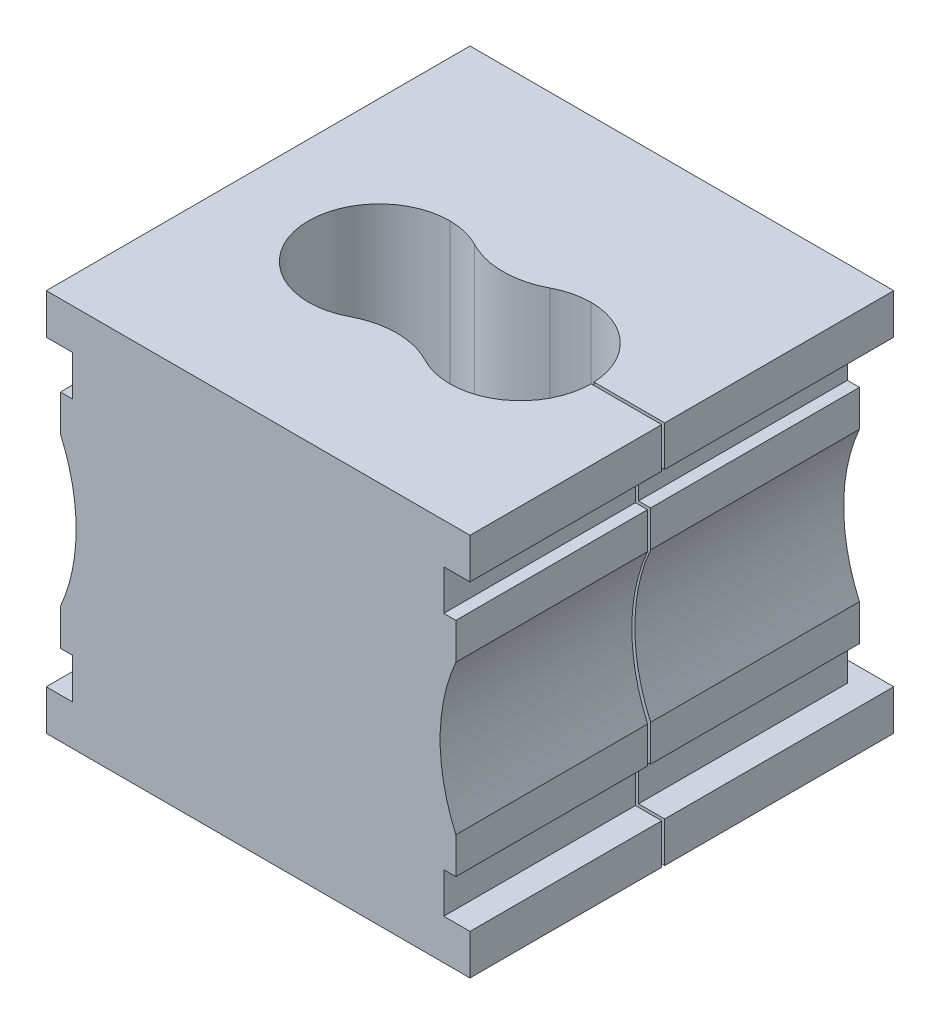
ISO-10303-21;
HEADER;
FILE_DESCRIPTION(('STEP AP214'),'2;1');
FILE_NAME('part.step','',(''),(''),'','','');
FILE_SCHEMA(('AUTOMOTIVE_DESIGN { 1 0 10303 214 1 1 1 1 }'));
ENDSEC;
DATA;
#1=APPLICATION_CONTEXT('core data for automotive mechanical design processes');
#2=APPLICATION_PROTOCOL_DEFINITION('international standard','automotive_design',2000,#1);
#3=PRODUCT_CONTEXT('',#1,'mechanical');
#4=PRODUCT('Part','Part','',(#3));
#5=PRODUCT_RELATED_PRODUCT_CATEGORY('part','',(#4));
#6=PRODUCT_DEFINITION_FORMATION('','',#4);
#7=PRODUCT_DEFINITION_CONTEXT('part definition',#1,'design');
#8=PRODUCT_DEFINITION('design','',#6,#7);
#9=PRODUCT_DEFINITION_SHAPE('','',#8);
#10=(LENGTH_UNIT() NAMED_UNIT(*) SI_UNIT(.MILLI.,.METRE.));
#11=(NAMED_UNIT(*) PLANE_ANGLE_UNIT() SI_UNIT($,.RADIAN.));
#12=(NAMED_UNIT(*) SI_UNIT($,.STERADIAN.) SOLID_ANGLE_UNIT());
#13=UNCERTAINTY_MEASURE_WITH_UNIT(LENGTH_MEASURE(1.E-05),#10,'distance_accuracy_value','');
#14=(GEOMETRIC_REPRESENTATION_CONTEXT(3) GLOBAL_UNCERTAINTY_ASSIGNED_CONTEXT((#13)) GLOBAL_UNIT_ASSIGNED_CONTEXT((#10,
#11,#12)) REPRESENTATION_CONTEXT('',''));
#15=CARTESIAN_POINT('',(0.,0.,0.));
#16=DIRECTION('',(0.,0.,1.));
#17=DIRECTION('',(1.,0.,0.));
#18=AXIS2_PLACEMENT_3D('',#15,#16,#17);
#19=CARTESIAN_POINT('',(0.,-9.65,0.85));
#20=DIRECTION('',(0.,0.,1.));
#21=DIRECTION('',(1.,0.,0.));
#22=AXIS2_PLACEMENT_3D('',#19,#20,#21);
#23=PLANE('',#22);
#24=DIRECTION('',(0.,1.,0.));
#25=VECTOR('',#24,1.);
#26=CARTESIAN_POINT('',(9.2,-7.5,0.85));
#27=LINE('',#26,#25);
#28=CARTESIAN_POINT('',(9.2,-7.5,0.85));
#29=VERTEX_POINT('',#28);
#30=CARTESIAN_POINT('',(9.2,-5.5,0.85));
#31=VERTEX_POINT('',#30);
#32=EDGE_CURVE('E447',#29,#31,#27,.T.);
#33=ORIENTED_EDGE('',*,*,#32,.T.);
#34=DIRECTION('',(1.,0.,0.));
#35=VECTOR('',#34,1.);
#36=CARTESIAN_POINT('',(9.2,-5.5,0.85));
#37=LINE('',#36,#35);
#38=CARTESIAN_POINT('',(9.8,-5.5,0.85));
#39=VERTEX_POINT('',#38);
#40=EDGE_CURVE('E431',#31,#39,#37,.T.);
#41=ORIENTED_EDGE('',*,*,#40,.T.);
#42=DIRECTION('',(0.,1.,0.));
#43=VECTOR('',#42,1.);
#44=CARTESIAN_POINT('',(9.8,-5.5,0.85));
#45=LINE('',#44,#43);
#46=CARTESIAN_POINT('',(9.8,-3.7,0.85));
#47=VERTEX_POINT('',#46);
#48=EDGE_CURVE('E485',#39,#47,#45,.T.);
#49=ORIENTED_EDGE('',*,*,#48,.T.);
#50=CARTESIAN_POINT('',(18.1701124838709,0.,0.85));
#51=DIRECTION('',(0.,0.,-1.));
#52=DIRECTION('',(1.,0.,0.));
#53=AXIS2_PLACEMENT_3D('',#50,#51,#52);
#54=CIRCLE('',#53,9.15143611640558);
#55=CARTESIAN_POINT('',(9.8,3.7,0.85));
#56=VERTEX_POINT('',#55);
#57=EDGE_CURVE('E519',#47,#56,#54,.T.);
#58=ORIENTED_EDGE('',*,*,#57,.T.);
#59=DIRECTION('',(0.,1.,0.));
#60=VECTOR('',#59,1.);
#61=CARTESIAN_POINT('',(9.8,5.5,0.85));
#62=LINE('',#61,#60);
#63=CARTESIAN_POINT('',(9.8,5.5,0.85));
#64=VERTEX_POINT('',#63);
#65=EDGE_CURVE('E527',#56,#64,#62,.T.);
#66=ORIENTED_EDGE('',*,*,#65,.T.);
#67=DIRECTION('',(-1.,0.,0.));
#68=VECTOR('',#67,1.);
#69=CARTESIAN_POINT('',(9.2,5.5,0.85));
#70=LINE('',#69,#68);
#71=CARTESIAN_POINT('',(9.2,5.5,0.85));
#72=VERTEX_POINT('',#71);
#73=EDGE_CURVE('E556',#64,#72,#70,.T.);
#74=ORIENTED_EDGE('',*,*,#73,.T.);
#75=DIRECTION('',(0.,1.,0.));
#76=VECTOR('',#75,1.);
#77=CARTESIAN_POINT('',(9.2,7.5,0.85));
#78=LINE('',#77,#76);
#79=CARTESIAN_POINT('',(9.2,7.5,0.85));
#80=VERTEX_POINT('',#79);
#81=EDGE_CURVE('E840',#72,#80,#78,.T.);
#82=ORIENTED_EDGE('',*,*,#81,.T.);
#83=DIRECTION('',(1.,0.,0.));
#84=VECTOR('',#83,1.);
#85=CARTESIAN_POINT('',(10.5,7.5,0.85));
#86=LINE('',#85,#84);
#87=CARTESIAN_POINT('',(10.5,7.5,0.85));
#88=VERTEX_POINT('',#87);
#89=EDGE_CURVE('E302',#80,#88,#86,.T.);
#90=ORIENTED_EDGE('',*,*,#89,.T.);
#91=DIRECTION('',(0.,1.,0.));
#92=VECTOR('',#91,1.);
#93=CARTESIAN_POINT('',(10.5,9.5,0.85));
#94=LINE('',#93,#92);
#95=CARTESIAN_POINT('',(10.5,9.5,0.85));
#96=VERTEX_POINT('',#95);
#97=EDGE_CURVE('E570',#88,#96,#94,.T.);
#98=ORIENTED_EDGE('',*,*,#97,.T.);
#99=DIRECTION('',(-1.,0.,0.));
#100=VECTOR('',#99,1.);
#101=CARTESIAN_POINT('',(-10.5,9.5,0.85));
#102=LINE('',#101,#100);
#103=CARTESIAN_POINT('',(6.99678423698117,9.5,0.85));
#104=VERTEX_POINT('',#103);
#105=EDGE_CURVE('E310',#96,#104,#102,.T.);
#106=ORIENTED_EDGE('',*,*,#105,.T.);
#107=DIRECTION('',(0.,-1.,0.));
#108=VECTOR('',#107,1.);
#109=CARTESIAN_POINT('',(6.99678423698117,10.5,0.85));
#110=LINE('',#109,#108);
#111=CARTESIAN_POINT('',(6.99678423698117,-9.5,0.85));
#112=VERTEX_POINT('',#111);
#113=EDGE_CURVE('E842',#104,#112,#110,.T.);
#114=ORIENTED_EDGE('',*,*,#113,.T.);
#115=DIRECTION('',(1.,0.,0.));
#116=VECTOR('',#115,1.);
#117=CARTESIAN_POINT('',(-10.5,-9.5,0.85));
#118=LINE('',#117,#116);
#119=CARTESIAN_POINT('',(10.5,-9.5,0.85));
#120=VERTEX_POINT('',#119);
#121=EDGE_CURVE('E589',#112,#120,#118,.T.);
#122=ORIENTED_EDGE('',*,*,#121,.T.);
#123=DIRECTION('',(0.,1.,0.));
#124=VECTOR('',#123,1.);
#125=CARTESIAN_POINT('',(10.5,9.5,0.85));
#126=LINE('',#125,#124);
#127=CARTESIAN_POINT('',(10.5,-7.5,0.85));
#128=VERTEX_POINT('',#127);
#129=EDGE_CURVE('E637',#120,#128,#126,.T.);
#130=ORIENTED_EDGE('',*,*,#129,.T.);
#131=DIRECTION('',(-1.,0.,0.));
#132=VECTOR('',#131,1.);
#133=CARTESIAN_POINT('',(10.5,-7.5,0.85));
#134=LINE('',#133,#132);
#135=EDGE_CURVE('E423',#128,#29,#134,.T.);
#136=ORIENTED_EDGE('',*,*,#135,.T.);
#137=EDGE_LOOP('',(#33,#41,#49,#58,#66,#74,#82,#90,#98,#106,#114,#122,#130,#136));
#138=FACE_BOUND('',#137,.T.);
#139=ADVANCED_FACE('F15',(#138),#23,.T.);
#140=CARTESIAN_POINT('',(0.,-9.65,1.));
#141=DIRECTION('',(0.,0.,1.));
#142=DIRECTION('',(1.,0.,0.));
#143=AXIS2_PLACEMENT_3D('',#140,#141,#142);
#144=PLANE('',#143);
#145=DIRECTION('',(-1.,0.,0.));
#146=VECTOR('',#145,1.);
#147=CARTESIAN_POINT('',(10.5,-7.5,1.));
#148=LINE('',#147,#146);
#149=CARTESIAN_POINT('',(10.5,-7.5,1.));
#150=VERTEX_POINT('',#149);
#151=CARTESIAN_POINT('',(9.2,-7.5,1.));
#152=VERTEX_POINT('',#151);
#153=EDGE_CURVE('E34',#150,#152,#148,.T.);
#154=ORIENTED_EDGE('',*,*,#153,.F.);
#155=DIRECTION('',(0.,1.,0.));
#156=VECTOR('',#155,1.);
#157=CARTESIAN_POINT('',(10.5,9.5,1.));
#158=LINE('',#157,#156);
#159=CARTESIAN_POINT('',(10.5,-9.5,1.));
#160=VERTEX_POINT('',#159);
#161=EDGE_CURVE('E804',#160,#150,#158,.T.);
#162=ORIENTED_EDGE('',*,*,#161,.F.);
#163=DIRECTION('',(1.,0.,0.));
#164=VECTOR('',#163,1.);
#165=CARTESIAN_POINT('',(-10.5,-9.5,1.));
#166=LINE('',#165,#164);
#167=CARTESIAN_POINT('',(7.,-9.5,1.));
#168=VERTEX_POINT('',#167);
#169=EDGE_CURVE('E608',#168,#160,#166,.T.);
#170=ORIENTED_EDGE('',*,*,#169,.F.);
#171=DIRECTION('',(0.,-1.,0.));
#172=VECTOR('',#171,1.);
#173=CARTESIAN_POINT('',(7.,10.5,1.));
#174=LINE('',#173,#172);
#175=CARTESIAN_POINT('',(7.,9.5,1.));
#176=VERTEX_POINT('',#175);
#177=EDGE_CURVE('E9',#176,#168,#174,.T.);
#178=ORIENTED_EDGE('',*,*,#177,.F.);
#179=DIRECTION('',(-1.,0.,0.));
#180=VECTOR('',#179,1.);
#181=CARTESIAN_POINT('',(-10.5,9.5,1.));
#182=LINE('',#181,#180);
#183=CARTESIAN_POINT('',(10.5,9.5,1.));
#184=VERTEX_POINT('',#183);
#185=EDGE_CURVE('E655',#184,#176,#182,.T.);
#186=ORIENTED_EDGE('',*,*,#185,.F.);
#187=DIRECTION('',(0.,1.,0.));
#188=VECTOR('',#187,1.);
#189=CARTESIAN_POINT('',(10.5,9.5,1.));
#190=LINE('',#189,#188);
#191=CARTESIAN_POINT('',(10.5,7.5,1.));
#192=VERTEX_POINT('',#191);
#193=EDGE_CURVE('E801',#192,#184,#190,.T.);
#194=ORIENTED_EDGE('',*,*,#193,.F.);
#195=DIRECTION('',(1.,0.,0.));
#196=VECTOR('',#195,1.);
#197=CARTESIAN_POINT('',(10.5,7.5,1.));
#198=LINE('',#197,#196);
#199=CARTESIAN_POINT('',(9.2,7.5,1.));
#200=VERTEX_POINT('',#199);
#201=EDGE_CURVE('E47',#200,#192,#198,.T.);
#202=ORIENTED_EDGE('',*,*,#201,.F.);
#203=DIRECTION('',(0.,1.,0.));
#204=VECTOR('',#203,1.);
#205=CARTESIAN_POINT('',(9.2,7.5,1.));
#206=LINE('',#205,#204);
#207=CARTESIAN_POINT('',(9.2,5.5,1.));
#208=VERTEX_POINT('',#207);
#209=EDGE_CURVE('E617',#208,#200,#206,.T.);
#210=ORIENTED_EDGE('',*,*,#209,.F.);
#211=DIRECTION('',(-1.,0.,0.));
#212=VECTOR('',#211,1.);
#213=CARTESIAN_POINT('',(9.2,5.5,1.));
#214=LINE('',#213,#212);
#215=CARTESIAN_POINT('',(9.8,5.5,1.));
#216=VERTEX_POINT('',#215);
#217=EDGE_CURVE('E577',#216,#208,#214,.T.);
#218=ORIENTED_EDGE('',*,*,#217,.F.);
#219=DIRECTION('',(0.,1.,0.));
#220=VECTOR('',#219,1.);
#221=CARTESIAN_POINT('',(9.8,5.5,1.));
#222=LINE('',#221,#220);
#223=CARTESIAN_POINT('',(9.8,3.7,1.));
#224=VERTEX_POINT('',#223);
#225=EDGE_CURVE('E674',#224,#216,#222,.T.);
#226=ORIENTED_EDGE('',*,*,#225,.F.);
#227=CARTESIAN_POINT('',(18.1701124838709,0.,1.));
#228=DIRECTION('',(0.,0.,-1.));
#229=DIRECTION('',(1.,0.,0.));
#230=AXIS2_PLACEMENT_3D('',#227,#228,#229);
#231=CIRCLE('',#230,9.15143611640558);
#232=CARTESIAN_POINT('',(9.8,-3.7,1.));
#233=VERTEX_POINT('',#232);
#234=EDGE_CURVE('E562',#233,#224,#231,.T.);
#235=ORIENTED_EDGE('',*,*,#234,.F.);
#236=DIRECTION('',(0.,1.,0.));
#237=VECTOR('',#236,1.);
#238=CARTESIAN_POINT('',(9.8,-5.5,1.));
#239=LINE('',#238,#237);
#240=CARTESIAN_POINT('',(9.8,-5.5,1.));
#241=VERTEX_POINT('',#240);
#242=EDGE_CURVE('E739',#241,#233,#239,.T.);
#243=ORIENTED_EDGE('',*,*,#242,.F.);
#244=DIRECTION('',(1.,0.,0.));
#245=VECTOR('',#244,1.);
#246=CARTESIAN_POINT('',(9.2,-5.5,1.));
#247=LINE('',#246,#245);
#248=CARTESIAN_POINT('',(9.2,-5.5,1.));
#249=VERTEX_POINT('',#248);
#250=EDGE_CURVE('E511',#249,#241,#247,.T.);
#251=ORIENTED_EDGE('',*,*,#250,.F.);
#252=DIRECTION('',(0.,1.,0.));
#253=VECTOR('',#252,1.);
#254=CARTESIAN_POINT('',(9.2,-7.5,1.));
#255=LINE('',#254,#253);
#256=EDGE_CURVE('E719',#152,#249,#255,.T.);
#257=ORIENTED_EDGE('',*,*,#256,.F.);
#258=EDGE_LOOP('',(#154,#162,#170,#178,#186,#194,#202,#210,#218,#226,#235,#243,#251,#257));
#259=FACE_BOUND('',#258,.T.);
#260=ADVANCED_FACE('F971',(#259),#144,.F.);
#261=CARTESIAN_POINT('',(-3.5,10.5,1.));
#262=DIRECTION('',(0.,-1.,0.));
#263=DIRECTION('',(0.,0.,-1.));
#264=AXIS2_PLACEMENT_3D('',#261,#262,#263);
#265=CYLINDRICAL_SURFACE('',#264,3.5);
#266=DIRECTION('',(0.,-1.,0.));
#267=VECTOR('',#266,1.);
#268=CARTESIAN_POINT('',(-3.5,10.5,4.5));
#269=LINE('',#268,#267);
#270=CARTESIAN_POINT('',(-3.5,9.5,4.5));
#271=VERTEX_POINT('',#270);
#272=CARTESIAN_POINT('',(-3.5,-9.5,4.5));
#273=VERTEX_POINT('',#272);
#274=EDGE_CURVE('E1023',#271,#273,#269,.T.);
#275=ORIENTED_EDGE('',*,*,#274,.F.);
#276=CARTESIAN_POINT('',(-3.5,9.5,1.));
#277=DIRECTION('',(0.,-1.,0.));
#278=DIRECTION('',(0.,0.,-1.));
#279=AXIS2_PLACEMENT_3D('',#276,#277,#278);
#280=CIRCLE('',#279,3.5);
#281=CARTESIAN_POINT('',(-1.86666666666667,9.5,4.09551647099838));
#282=VERTEX_POINT('',#281);
#283=EDGE_CURVE('E542',#282,#271,#280,.T.);
#284=ORIENTED_EDGE('',*,*,#283,.F.);
#285=DIRECTION('',(0.,-1.,0.));
#286=VECTOR('',#285,1.);
#287=CARTESIAN_POINT('',(-1.86666666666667,10.5,4.09551647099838));
#288=LINE('',#287,#286);
#289=CARTESIAN_POINT('',(-1.86666666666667,-9.5,4.09551647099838));
#290=VERTEX_POINT('',#289);
#291=EDGE_CURVE('E914',#282,#290,#288,.T.);
#292=ORIENTED_EDGE('',*,*,#291,.T.);
#293=CARTESIAN_POINT('',(-3.5,-9.5,1.));
#294=DIRECTION('',(0.,-1.,0.));
#295=DIRECTION('',(0.,0.,-1.));
#296=AXIS2_PLACEMENT_3D('',#293,#294,#295);
#297=CIRCLE('',#296,3.5);
#298=EDGE_CURVE('E600',#290,#273,#297,.T.);
#299=ORIENTED_EDGE('',*,*,#298,.T.);
#300=EDGE_LOOP('',(#275,#284,#292,#299));
#301=FACE_BOUND('',#300,.T.);
#302=ADVANCED_FACE('F1063',(#301),#265,.F.);
#303=CARTESIAN_POINT('',(0.,10.5,-5.6332495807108));
#304=DIRECTION('',(0.,-1.,0.));
#305=DIRECTION('',(0.,0.,-1.));
#306=AXIS2_PLACEMENT_3D('',#303,#304,#305);
#307=CYLINDRICAL_SURFACE('',#306,4.);
#308=DIRECTION('',(0.,-1.,0.));
#309=VECTOR('',#308,1.);
#310=CARTESIAN_POINT('',(-1.86666666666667,10.5,-2.09551647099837));
#311=LINE('',#310,#309);
#312=CARTESIAN_POINT('',(-1.86666666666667,9.5,-2.09551647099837));
#313=VERTEX_POINT('',#312);
#314=CARTESIAN_POINT('',(-1.86666666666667,-9.5,-2.09551647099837));
#315=VERTEX_POINT('',#314);
#316=EDGE_CURVE('E901',#313,#315,#311,.T.);
#317=ORIENTED_EDGE('',*,*,#316,.T.);
#318=CARTESIAN_POINT('',(0.,-9.5,-5.6332495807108));
#319=DIRECTION('',(0.,1.,0.));
#320=DIRECTION('',(0.,0.,-1.));
#321=AXIS2_PLACEMENT_3D('',#318,#319,#320);
#322=CIRCLE('',#321,4.);
#323=CARTESIAN_POINT('',(1.86666666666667,-9.5,-2.09551647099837));
#324=VERTEX_POINT('',#323);
#325=EDGE_CURVE('E596',#315,#324,#322,.T.);
#326=ORIENTED_EDGE('',*,*,#325,.T.);
#327=DIRECTION('',(0.,-1.,0.));
#328=VECTOR('',#327,1.);
#329=CARTESIAN_POINT('',(1.86666666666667,10.5,-2.09551647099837));
#330=LINE('',#329,#328);
#331=CARTESIAN_POINT('',(1.86666666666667,9.5,-2.09551647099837));
#332=VERTEX_POINT('',#331);
#333=EDGE_CURVE('E532',#332,#324,#330,.T.);
#334=ORIENTED_EDGE('',*,*,#333,.F.);
#335=CARTESIAN_POINT('',(0.,9.5,-5.6332495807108));
#336=DIRECTION('',(0.,1.,0.));
#337=DIRECTION('',(0.,0.,-1.));
#338=AXIS2_PLACEMENT_3D('',#335,#336,#337);
#339=CIRCLE('',#338,4.);
#340=EDGE_CURVE('E537',#313,#332,#339,.T.);
#341=ORIENTED_EDGE('',*,*,#340,.F.);
#342=EDGE_LOOP('',(#317,#326,#334,#341));
#343=FACE_BOUND('',#342,.T.);
#344=ADVANCED_FACE('F1049',(#343),#307,.T.);
#345=CARTESIAN_POINT('',(3.5,10.5,1.));
#346=DIRECTION('',(0.,-1.,0.));
#347=DIRECTION('',(0.,0.,-1.));
#348=AXIS2_PLACEMENT_3D('',#345,#346,#347);
#349=CYLINDRICAL_SURFACE('',#348,3.5);
#350=CARTESIAN_POINT('',(3.5,9.5,1.));
#351=DIRECTION('',(0.,-1.,0.));
#352=DIRECTION('',(0.,0.,-1.));
#353=AXIS2_PLACEMENT_3D('',#350,#351,#352);
#354=CIRCLE('',#353,3.5);
#355=CARTESIAN_POINT('',(1.86666666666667,9.5,4.09551647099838));
#356=VERTEX_POINT('',#355);
#357=EDGE_CURVE('E664',#176,#356,#354,.T.);
#358=ORIENTED_EDGE('',*,*,#357,.F.);
#359=ORIENTED_EDGE('',*,*,#177,.T.);
#360=CARTESIAN_POINT('',(3.5,-9.5,1.));
#361=DIRECTION('',(0.,-1.,0.));
#362=DIRECTION('',(0.,0.,-1.));
#363=AXIS2_PLACEMENT_3D('',#360,#361,#362);
#364=CIRCLE('',#363,3.5);
#365=CARTESIAN_POINT('',(1.86666666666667,-9.5,4.09551647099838));
#366=VERTEX_POINT('',#365);
#367=EDGE_CURVE('E604',#168,#366,#364,.T.);
#368=ORIENTED_EDGE('',*,*,#367,.T.);
#369=DIRECTION('',(0.,-1.,0.));
#370=VECTOR('',#369,1.);
#371=CARTESIAN_POINT('',(1.86666666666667,10.5,4.09551647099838));
#372=LINE('',#371,#370);
#373=EDGE_CURVE('E23',#356,#366,#372,.T.);
#374=ORIENTED_EDGE('',*,*,#373,.F.);
#375=EDGE_LOOP('',(#358,#359,#368,#374));
#376=FACE_BOUND('',#375,.T.);
#377=ADVANCED_FACE('F825',(#376),#349,.F.);
#378=CARTESIAN_POINT('',(0.,10.5,7.6332495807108));
#379=DIRECTION('',(0.,-1.,0.));
#380=DIRECTION('',(0.,0.,-1.));
#381=AXIS2_PLACEMENT_3D('',#378,#379,#380);
#382=CYLINDRICAL_SURFACE('',#381,4.);
#383=DIRECTION('',(0.,-1.,0.));
#384=VECTOR('',#383,1.);
#385=CARTESIAN_POINT('',(0.,10.5,3.6332495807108));
#386=LINE('',#385,#384);
#387=CARTESIAN_POINT('',(0.,9.5,3.6332495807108));
#388=VERTEX_POINT('',#387);
#389=CARTESIAN_POINT('',(0.,-9.5,3.6332495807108));
#390=VERTEX_POINT('',#389);
#391=EDGE_CURVE('E909',#388,#390,#386,.T.);
#392=ORIENTED_EDGE('',*,*,#391,.F.);
#393=CARTESIAN_POINT('',(0.,9.5,7.6332495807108));
#394=DIRECTION('',(0.,1.,0.));
#395=DIRECTION('',(0.,0.,-1.));
#396=AXIS2_PLACEMENT_3D('',#393,#394,#395);
#397=CIRCLE('',#396,4.);
#398=EDGE_CURVE('E668',#356,#388,#397,.T.);
#399=ORIENTED_EDGE('',*,*,#398,.F.);
#400=ORIENTED_EDGE('',*,*,#373,.T.);
#401=CARTESIAN_POINT('',(0.,-9.5,7.6332495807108));
#402=DIRECTION('',(0.,1.,0.));
#403=DIRECTION('',(0.,0.,-1.));
#404=AXIS2_PLACEMENT_3D('',#401,#402,#403);
#405=CIRCLE('',#404,4.);
#406=EDGE_CURVE('E603',#366,#390,#405,.T.);
#407=ORIENTED_EDGE('',*,*,#406,.T.);
#408=EDGE_LOOP('',(#392,#399,#400,#407));
#409=FACE_BOUND('',#408,.T.);
#410=ADVANCED_FACE('F819',(#409),#382,.T.);
#411=CARTESIAN_POINT('',(14.1151612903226,-7.5,-9.5));
#412=DIRECTION('',(0.,0.,-1.));
#413=DIRECTION('',(0.,-1.,0.));
#414=AXIS2_PLACEMENT_3D('',#411,#412,#413);
#415=PLANE('',#414);
#416=DIRECTION('',(0.,-1.,0.));
#417=VECTOR('',#416,1.);
#418=CARTESIAN_POINT('',(9.2,7.5,-9.5));
#419=LINE('',#418,#417);
#420=CARTESIAN_POINT('',(9.2,7.5,-9.5));
#421=VERTEX_POINT('',#420);
#422=CARTESIAN_POINT('',(9.2,5.5,-9.5));
#423=VERTEX_POINT('',#422);
#424=EDGE_CURVE('E461',#421,#423,#419,.T.);
#425=ORIENTED_EDGE('',*,*,#424,.T.);
#426=DIRECTION('',(1.,0.,0.));
#427=VECTOR('',#426,1.);
#428=CARTESIAN_POINT('',(9.2,5.5,-9.5));
#429=LINE('',#428,#427);
#430=CARTESIAN_POINT('',(9.8,5.5,-9.5));
#431=VERTEX_POINT('',#430);
#432=EDGE_CURVE('E567',#423,#431,#429,.T.);
#433=ORIENTED_EDGE('',*,*,#432,.T.);
#434=DIRECTION('',(0.,-1.,0.));
#435=VECTOR('',#434,1.);
#436=CARTESIAN_POINT('',(9.8,5.5,-9.5));
#437=LINE('',#436,#435);
#438=CARTESIAN_POINT('',(9.8,3.7,-9.5));
#439=VERTEX_POINT('',#438);
#440=EDGE_CURVE('E531',#431,#439,#437,.T.);
#441=ORIENTED_EDGE('',*,*,#440,.T.);
#442=CARTESIAN_POINT('',(18.1701124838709,0.,-9.5));
#443=DIRECTION('',(0.,0.,1.));
#444=DIRECTION('',(-1.,0.,0.));
#445=AXIS2_PLACEMENT_3D('',#442,#443,#444);
#446=CIRCLE('',#445,9.15143611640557);
#447=CARTESIAN_POINT('',(9.8,-3.7,-9.5));
#448=VERTEX_POINT('',#447);
#449=EDGE_CURVE('E520',#439,#448,#446,.T.);
#450=ORIENTED_EDGE('',*,*,#449,.T.);
#451=DIRECTION('',(0.,-1.,0.));
#452=VECTOR('',#451,1.);
#453=CARTESIAN_POINT('',(9.8,-5.5,-9.5));
#454=LINE('',#453,#452);
#455=CARTESIAN_POINT('',(9.8,-5.5,-9.5));
#456=VERTEX_POINT('',#455);
#457=EDGE_CURVE('E498',#448,#456,#454,.T.);
#458=ORIENTED_EDGE('',*,*,#457,.T.);
#459=DIRECTION('',(-1.,0.,0.));
#460=VECTOR('',#459,1.);
#461=CARTESIAN_POINT('',(9.2,-5.5,-9.5));
#462=LINE('',#461,#460);
#463=CARTESIAN_POINT('',(9.2,-5.5,-9.5));
#464=VERTEX_POINT('',#463);
#465=EDGE_CURVE('E441',#456,#464,#462,.T.);
#466=ORIENTED_EDGE('',*,*,#465,.T.);
#467=DIRECTION('',(0.,-1.,0.));
#468=VECTOR('',#467,1.);
#469=CARTESIAN_POINT('',(9.2,-7.5,-9.5));
#470=LINE('',#469,#468);
#471=CARTESIAN_POINT('',(9.2,-7.5,-9.5));
#472=VERTEX_POINT('',#471);
#473=EDGE_CURVE('E449',#464,#472,#470,.T.);
#474=ORIENTED_EDGE('',*,*,#473,.T.);
#475=DIRECTION('',(-1.,0.,0.));
#476=VECTOR('',#475,1.);
#477=CARTESIAN_POINT('',(14.1151612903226,-7.5,-9.5));
#478=LINE('',#477,#476);
#479=CARTESIAN_POINT('',(-9.2,-7.5,-9.5));
#480=VERTEX_POINT('',#479);
#481=EDGE_CURVE('E536',#472,#480,#478,.T.);
#482=ORIENTED_EDGE('',*,*,#481,.T.);
#483=DIRECTION('',(0.,-1.,0.));
#484=VECTOR('',#483,1.);
#485=CARTESIAN_POINT('',(-9.2,-7.5,-9.5));
#486=LINE('',#485,#484);
#487=CARTESIAN_POINT('',(-9.2,-5.5,-9.5));
#488=VERTEX_POINT('',#487);
#489=EDGE_CURVE('E659',#488,#480,#486,.T.);
#490=ORIENTED_EDGE('',*,*,#489,.F.);
#491=DIRECTION('',(1.,0.,0.));
#492=VECTOR('',#491,1.);
#493=CARTESIAN_POINT('',(-9.2,-5.5,-9.5));
#494=LINE('',#493,#492);
#495=CARTESIAN_POINT('',(-9.8,-5.5,-9.5));
#496=VERTEX_POINT('',#495);
#497=EDGE_CURVE('E218',#496,#488,#494,.T.);
#498=ORIENTED_EDGE('',*,*,#497,.F.);
#499=DIRECTION('',(0.,-1.,0.));
#500=VECTOR('',#499,1.);
#501=CARTESIAN_POINT('',(-9.8,-5.5,-9.5));
#502=LINE('',#501,#500);
#503=CARTESIAN_POINT('',(-9.8,-3.7,-9.5));
#504=VERTEX_POINT('',#503);
#505=EDGE_CURVE('E770',#504,#496,#502,.T.);
#506=ORIENTED_EDGE('',*,*,#505,.F.);
#507=CARTESIAN_POINT('',(-18.1701124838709,0.,-9.5));
#508=DIRECTION('',(0.,0.,-1.));
#509=DIRECTION('',(-1.,0.,0.));
#510=AXIS2_PLACEMENT_3D('',#507,#508,#509);
#511=CIRCLE('',#510,9.15143611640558);
#512=CARTESIAN_POINT('',(-9.01867636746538,0.,-9.5));
#513=VERTEX_POINT('',#512);
#514=EDGE_CURVE('E465',#513,#504,#511,.T.);
#515=ORIENTED_EDGE('',*,*,#514,.F.);
#516=CARTESIAN_POINT('',(-18.1701124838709,0.,-9.5));
#517=DIRECTION('',(0.,0.,-1.));
#518=DIRECTION('',(-1.,0.,0.));
#519=AXIS2_PLACEMENT_3D('',#516,#517,#518);
#520=CIRCLE('',#519,9.15143611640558);
#521=CARTESIAN_POINT('',(-9.8,3.7,-9.5));
#522=VERTEX_POINT('',#521);
#523=EDGE_CURVE('E858',#522,#513,#520,.T.);
#524=ORIENTED_EDGE('',*,*,#523,.F.);
#525=DIRECTION('',(0.,-1.,0.));
#526=VECTOR('',#525,1.);
#527=CARTESIAN_POINT('',(-9.8,5.5,-9.5));
#528=LINE('',#527,#526);
#529=CARTESIAN_POINT('',(-9.8,5.5,-9.5));
#530=VERTEX_POINT('',#529);
#531=EDGE_CURVE('E546',#530,#522,#528,.T.);
#532=ORIENTED_EDGE('',*,*,#531,.F.);
#533=DIRECTION('',(-1.,0.,0.));
#534=VECTOR('',#533,1.);
#535=CARTESIAN_POINT('',(-9.2,5.5,-9.5));
#536=LINE('',#535,#534);
#537=CARTESIAN_POINT('',(-9.2,5.5,-9.5));
#538=VERTEX_POINT('',#537);
#539=EDGE_CURVE('E696',#538,#530,#536,.T.);
#540=ORIENTED_EDGE('',*,*,#539,.F.);
#541=DIRECTION('',(0.,-1.,0.));
#542=VECTOR('',#541,1.);
#543=CARTESIAN_POINT('',(-9.2,7.5,-9.5));
#544=LINE('',#543,#542);
#545=CARTESIAN_POINT('',(-9.2,7.5,-9.5));
#546=VERTEX_POINT('',#545);
#547=EDGE_CURVE('E758',#546,#538,#544,.T.);
#548=ORIENTED_EDGE('',*,*,#547,.F.);
#549=DIRECTION('',(1.,0.,0.));
#550=VECTOR('',#549,1.);
#551=CARTESIAN_POINT('',(14.1151612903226,7.5,-9.5));
#552=LINE('',#551,#550);
#553=EDGE_CURVE('E563',#546,#421,#552,.T.);
#554=ORIENTED_EDGE('',*,*,#553,.T.);
#555=EDGE_LOOP('',(#425,#433,#441,#450,#458,#466,#474,#482,#490,#498,#506,#515,#524,#532,#540,
#548,#554));
#556=FACE_BOUND('',#555,.T.);
#557=ADVANCED_FACE('F937',(#556),#415,.T.);
#558=CARTESIAN_POINT('',(10.5,-7.5,-11.5));
#559=DIRECTION('',(0.,-1.,0.));
#560=DIRECTION('',(0.,0.,-1.));
#561=AXIS2_PLACEMENT_3D('',#558,#559,#560);
#562=PLANE('',#561);
#563=DIRECTION('',(0.,0.,1.));
#564=VECTOR('',#563,1.);
#565=CARTESIAN_POINT('',(10.5,-7.5,-11.5));
#566=LINE('',#565,#564);
#567=CARTESIAN_POINT('',(10.5,-7.5,10.5));
#568=VERTEX_POINT('',#567);
#569=EDGE_CURVE('E808',#150,#568,#566,.T.);
#570=ORIENTED_EDGE('',*,*,#569,.F.);
#571=ORIENTED_EDGE('',*,*,#153,.T.);
#572=DIRECTION('',(0.,0.,1.));
#573=VECTOR('',#572,1.);
#574=CARTESIAN_POINT('',(9.2,-7.5,-11.5));
#575=LINE('',#574,#573);
#576=CARTESIAN_POINT('',(9.2,-7.5,10.5));
#577=VERTEX_POINT('',#576);
#578=EDGE_CURVE('E631',#152,#577,#575,.T.);
#579=ORIENTED_EDGE('',*,*,#578,.T.);
#580=DIRECTION('',(1.,0.,0.));
#581=VECTOR('',#580,1.);
#582=CARTESIAN_POINT('',(10.5,-7.5,10.5));
#583=LINE('',#582,#581);
#584=EDGE_CURVE('E788',#577,#568,#583,.T.);
#585=ORIENTED_EDGE('',*,*,#584,.T.);
#586=EDGE_LOOP('',(#570,#571,#579,#585));
#587=FACE_BOUND('',#586,.T.);
#588=ADVANCED_FACE('F989',(#587),#562,.F.);
#589=CARTESIAN_POINT('',(10.5,7.5,-11.5));
#590=DIRECTION('',(0.,1.,0.));
#591=DIRECTION('',(1.,0.,0.));
#592=AXIS2_PLACEMENT_3D('',#589,#590,#591);
#593=PLANE('',#592);
#594=DIRECTION('',(0.,0.,1.));
#595=VECTOR('',#594,1.);
#596=CARTESIAN_POINT('',(9.2,7.5,-11.5));
#597=LINE('',#596,#595);
#598=CARTESIAN_POINT('',(9.2,7.5,10.5));
#599=VERTEX_POINT('',#598);
#600=EDGE_CURVE('E621',#200,#599,#597,.T.);
#601=ORIENTED_EDGE('',*,*,#600,.F.);
#602=ORIENTED_EDGE('',*,*,#201,.T.);
#603=DIRECTION('',(0.,0.,1.));
#604=VECTOR('',#603,1.);
#605=CARTESIAN_POINT('',(10.5,7.5,-11.5));
#606=LINE('',#605,#604);
#607=CARTESIAN_POINT('',(10.5,7.5,10.5));
#608=VERTEX_POINT('',#607);
#609=EDGE_CURVE('E798',#192,#608,#606,.T.);
#610=ORIENTED_EDGE('',*,*,#609,.T.);
#611=DIRECTION('',(-1.,0.,0.));
#612=VECTOR('',#611,1.);
#613=CARTESIAN_POINT('',(10.5,7.5,10.5));
#614=LINE('',#613,#612);
#615=EDGE_CURVE('E792',#608,#599,#614,.T.);
#616=ORIENTED_EDGE('',*,*,#615,.T.);
#617=EDGE_LOOP('',(#601,#602,#610,#616));
#618=FACE_BOUND('',#617,.T.);
#619=ADVANCED_FACE('F1119',(#618),#593,.F.);
#620=CARTESIAN_POINT('',(10.5,9.5,10.5));
#621=DIRECTION('',(-1.,0.,0.));
#622=DIRECTION('',(0.,1.,0.));
#623=AXIS2_PLACEMENT_3D('',#620,#621,#622);
#624=PLANE('',#623);
#625=DIRECTION('',(0.,0.,-1.));
#626=VECTOR('',#625,1.);
#627=CARTESIAN_POINT('',(10.5,-9.5,10.5));
#628=LINE('',#627,#626);
#629=CARTESIAN_POINT('',(10.5,-9.5,10.5));
#630=VERTEX_POINT('',#629);
#631=EDGE_CURVE('E612',#630,#160,#628,.T.);
#632=ORIENTED_EDGE('',*,*,#631,.T.);
#633=ORIENTED_EDGE('',*,*,#161,.T.);
#634=ORIENTED_EDGE('',*,*,#569,.T.);
#635=DIRECTION('',(0.,1.,0.));
#636=VECTOR('',#635,1.);
#637=CARTESIAN_POINT('',(10.5,9.5,10.5));
#638=LINE('',#637,#636);
#639=EDGE_CURVE('E784',#630,#568,#638,.T.);
#640=ORIENTED_EDGE('',*,*,#639,.F.);
#641=EDGE_LOOP('',(#632,#633,#634,#640));
#642=FACE_BOUND('',#641,.T.);
#643=ADVANCED_FACE('F991',(#642),#624,.F.);
#644=CARTESIAN_POINT('',(10.5,9.5,10.5));
#645=DIRECTION('',(-1.,0.,0.));
#646=DIRECTION('',(0.,1.,0.));
#647=AXIS2_PLACEMENT_3D('',#644,#645,#646);
#648=PLANE('',#647);
#649=ORIENTED_EDGE('',*,*,#609,.F.);
#650=ORIENTED_EDGE('',*,*,#193,.T.);
#651=DIRECTION('',(0.,0.,-1.));
#652=VECTOR('',#651,1.);
#653=CARTESIAN_POINT('',(10.5,9.5,10.5));
#654=LINE('',#653,#652);
#655=CARTESIAN_POINT('',(10.5,9.5,10.5));
#656=VERTEX_POINT('',#655);
#657=EDGE_CURVE('E515',#656,#184,#654,.T.);
#658=ORIENTED_EDGE('',*,*,#657,.F.);
#659=DIRECTION('',(0.,1.,0.));
#660=VECTOR('',#659,1.);
#661=CARTESIAN_POINT('',(10.5,9.5,10.5));
#662=LINE('',#661,#660);
#663=EDGE_CURVE('E795',#608,#656,#662,.T.);
#664=ORIENTED_EDGE('',*,*,#663,.F.);
#665=EDGE_LOOP('',(#649,#650,#658,#664));
#666=FACE_BOUND('',#665,.T.);
#667=ADVANCED_FACE('F1118',(#666),#648,.F.);
#668=CARTESIAN_POINT('',(-10.5,9.5,-10.5));
#669=DIRECTION('',(0.,0.,1.));
#670=DIRECTION('',(1.,0.,0.));
#671=AXIS2_PLACEMENT_3D('',#668,#669,#670);
#672=PLANE('',#671);
#673=DIRECTION('',(0.,-1.,0.));
#674=VECTOR('',#673,1.);
#675=CARTESIAN_POINT('',(-10.5,9.5,-10.5));
#676=LINE('',#675,#674);
#677=CARTESIAN_POINT('',(-10.5,-7.5,-10.5));
#678=VERTEX_POINT('',#677);
#679=CARTESIAN_POINT('',(-10.5,-9.5,-10.5));
#680=VERTEX_POINT('',#679);
#681=EDGE_CURVE('E736',#678,#680,#676,.T.);
#682=ORIENTED_EDGE('',*,*,#681,.F.);
#683=DIRECTION('',(1.,0.,0.));
#684=VECTOR('',#683,1.);
#685=CARTESIAN_POINT('',(-10.5,-7.5,-10.5));
#686=LINE('',#685,#684);
#687=CARTESIAN_POINT('',(10.5,-7.5,-10.5));
#688=VERTEX_POINT('',#687);
#689=EDGE_CURVE('E479',#678,#688,#686,.T.);
#690=ORIENTED_EDGE('',*,*,#689,.T.);
#691=DIRECTION('',(0.,1.,0.));
#692=VECTOR('',#691,1.);
#693=CARTESIAN_POINT('',(10.5,9.5,-10.5));
#694=LINE('',#693,#692);
#695=CARTESIAN_POINT('',(10.5,-9.5,-10.5));
#696=VERTEX_POINT('',#695);
#697=EDGE_CURVE('E640',#696,#688,#694,.T.);
#698=ORIENTED_EDGE('',*,*,#697,.F.);
#699=DIRECTION('',(1.,0.,0.));
#700=VECTOR('',#699,1.);
#701=CARTESIAN_POINT('',(-10.5,-9.5,-10.5));
#702=LINE('',#701,#700);
#703=EDGE_CURVE('E632',#680,#696,#702,.T.);
#704=ORIENTED_EDGE('',*,*,#703,.F.);
#705=EDGE_LOOP('',(#682,#690,#698,#704));
#706=FACE_BOUND('',#705,.T.);
#707=ADVANCED_FACE('F1185',(#706),#672,.F.);
#708=CARTESIAN_POINT('',(-10.5,9.5,10.5));
#709=DIRECTION('',(0.,0.,1.));
#710=DIRECTION('',(1.,0.,0.));
#711=AXIS2_PLACEMENT_3D('',#708,#709,#710);
#712=PLANE('',#711);
#713=DIRECTION('',(0.,-1.,0.));
#714=VECTOR('',#713,1.);
#715=CARTESIAN_POINT('',(-9.2,-7.5,10.5));
#716=LINE('',#715,#714);
#717=CARTESIAN_POINT('',(-9.2,-5.5,10.5));
#718=VERTEX_POINT('',#717);
#719=CARTESIAN_POINT('',(-9.2,-7.5,10.5));
#720=VERTEX_POINT('',#719);
#721=EDGE_CURVE('E733',#718,#720,#716,.T.);
#722=ORIENTED_EDGE('',*,*,#721,.T.);
#723=DIRECTION('',(-1.,0.,0.));
#724=VECTOR('',#723,1.);
#725=CARTESIAN_POINT('',(-10.5,-7.5,10.5));
#726=LINE('',#725,#724);
#727=CARTESIAN_POINT('',(-10.5,-7.5,10.5));
#728=VERTEX_POINT('',#727);
#729=EDGE_CURVE('E691',#720,#728,#726,.T.);
#730=ORIENTED_EDGE('',*,*,#729,.T.);
#731=DIRECTION('',(0.,-1.,0.));
#732=VECTOR('',#731,1.);
#733=CARTESIAN_POINT('',(-10.5,9.5,10.5));
#734=LINE('',#733,#732);
#735=CARTESIAN_POINT('',(-10.5,-9.5,10.5));
#736=VERTEX_POINT('',#735);
#737=EDGE_CURVE('E778',#728,#736,#734,.T.);
#738=ORIENTED_EDGE('',*,*,#737,.T.);
#739=DIRECTION('',(1.,0.,0.));
#740=VECTOR('',#739,1.);
#741=CARTESIAN_POINT('',(-10.5,-9.5,10.5));
#742=LINE('',#741,#740);
#743=EDGE_CURVE('E616',#736,#630,#742,.T.);
#744=ORIENTED_EDGE('',*,*,#743,.T.);
#745=ORIENTED_EDGE('',*,*,#639,.T.);
#746=ORIENTED_EDGE('',*,*,#584,.F.);
#747=DIRECTION('',(0.,-1.,0.));
#748=VECTOR('',#747,1.);
#749=CARTESIAN_POINT('',(9.2,-7.5,10.5));
#750=LINE('',#749,#748);
#751=CARTESIAN_POINT('',(9.2,-5.5,10.5));
#752=VERTEX_POINT('',#751);
#753=EDGE_CURVE('E663',#752,#577,#750,.T.);
#754=ORIENTED_EDGE('',*,*,#753,.F.);
#755=DIRECTION('',(-1.,0.,0.));
#756=VECTOR('',#755,1.);
#757=CARTESIAN_POINT('',(9.2,-5.5,10.5));
#758=LINE('',#757,#756);
#759=CARTESIAN_POINT('',(9.8,-5.5,10.5));
#760=VERTEX_POINT('',#759);
#761=EDGE_CURVE('E510',#760,#752,#758,.T.);
#762=ORIENTED_EDGE('',*,*,#761,.F.);
#763=DIRECTION('',(0.,-1.,0.));
#764=VECTOR('',#763,1.);
#765=CARTESIAN_POINT('',(9.8,-5.5,10.5));
#766=LINE('',#765,#764);
#767=CARTESIAN_POINT('',(9.8,-3.7,10.5));
#768=VERTEX_POINT('',#767);
#769=EDGE_CURVE('E744',#768,#760,#766,.T.);
#770=ORIENTED_EDGE('',*,*,#769,.F.);
#771=CARTESIAN_POINT('',(18.1701124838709,0.,10.5));
#772=DIRECTION('',(0.,0.,1.));
#773=DIRECTION('',(1.,0.,0.));
#774=AXIS2_PLACEMENT_3D('',#771,#772,#773);
#775=CIRCLE('',#774,9.15143611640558);
#776=CARTESIAN_POINT('',(9.8,3.7,10.5));
#777=VERTEX_POINT('',#776);
#778=EDGE_CURVE('E561',#777,#768,#775,.T.);
#779=ORIENTED_EDGE('',*,*,#778,.F.);
#780=DIRECTION('',(0.,-1.,0.));
#781=VECTOR('',#780,1.);
#782=CARTESIAN_POINT('',(9.8,5.5,10.5));
#783=LINE('',#782,#781);
#784=CARTESIAN_POINT('',(9.8,5.5,10.5));
#785=VERTEX_POINT('',#784);
#786=EDGE_CURVE('E582',#785,#777,#783,.T.);
#787=ORIENTED_EDGE('',*,*,#786,.F.);
#788=DIRECTION('',(1.,0.,0.));
#789=VECTOR('',#788,1.);
#790=CARTESIAN_POINT('',(9.2,5.5,10.5));
#791=LINE('',#790,#789);
#792=CARTESIAN_POINT('',(9.2,5.5,10.5));
#793=VERTEX_POINT('',#792);
#794=EDGE_CURVE('E581',#793,#785,#791,.T.);
#795=ORIENTED_EDGE('',*,*,#794,.F.);
#796=DIRECTION('',(0.,-1.,0.));
#797=VECTOR('',#796,1.);
#798=CARTESIAN_POINT('',(9.2,7.5,10.5));
#799=LINE('',#798,#797);
#800=EDGE_CURVE('E627',#599,#793,#799,.T.);
#801=ORIENTED_EDGE('',*,*,#800,.F.);
#802=ORIENTED_EDGE('',*,*,#615,.F.);
#803=ORIENTED_EDGE('',*,*,#663,.T.);
#804=DIRECTION('',(-1.,0.,0.));
#805=VECTOR('',#804,1.);
#806=CARTESIAN_POINT('',(-10.5,9.5,10.5));
#807=LINE('',#806,#805);
#808=CARTESIAN_POINT('',(-10.5,9.5,10.5));
#809=VERTEX_POINT('',#808);
#810=EDGE_CURVE('E502',#656,#809,#807,.T.);
#811=ORIENTED_EDGE('',*,*,#810,.T.);
#812=DIRECTION('',(0.,-1.,0.));
#813=VECTOR('',#812,1.);
#814=CARTESIAN_POINT('',(-10.5,9.5,10.5));
#815=LINE('',#814,#813);
#816=CARTESIAN_POINT('',(-10.5,7.5,10.5));
#817=VERTEX_POINT('',#816);
#818=EDGE_CURVE('E781',#809,#817,#815,.T.);
#819=ORIENTED_EDGE('',*,*,#818,.T.);
#820=DIRECTION('',(1.,0.,0.));
#821=VECTOR('',#820,1.);
#822=CARTESIAN_POINT('',(-10.5,7.5,10.5));
#823=LINE('',#822,#821);
#824=CARTESIAN_POINT('',(-9.2,7.5,10.5));
#825=VERTEX_POINT('',#824);
#826=EDGE_CURVE('E678',#817,#825,#823,.T.);
#827=ORIENTED_EDGE('',*,*,#826,.T.);
#828=DIRECTION('',(0.,-1.,0.));
#829=VECTOR('',#828,1.);
#830=CARTESIAN_POINT('',(-9.2,7.5,10.5));
#831=LINE('',#830,#829);
#832=CARTESIAN_POINT('',(-9.2,5.5,10.5));
#833=VERTEX_POINT('',#832);
#834=EDGE_CURVE('E701',#825,#833,#831,.T.);
#835=ORIENTED_EDGE('',*,*,#834,.T.);
#836=DIRECTION('',(-1.,0.,0.));
#837=VECTOR('',#836,1.);
#838=CARTESIAN_POINT('',(-9.2,5.5,10.5));
#839=LINE('',#838,#837);
#840=CARTESIAN_POINT('',(-9.8,5.5,10.5));
#841=VERTEX_POINT('',#840);
#842=EDGE_CURVE('E550',#833,#841,#839,.T.);
#843=ORIENTED_EDGE('',*,*,#842,.T.);
#844=DIRECTION('',(0.,-1.,0.));
#845=VECTOR('',#844,1.);
#846=CARTESIAN_POINT('',(-9.8,5.5,10.5));
#847=LINE('',#846,#845);
#848=CARTESIAN_POINT('',(-9.8,3.7,10.5));
#849=VERTEX_POINT('',#848);
#850=EDGE_CURVE('E470',#841,#849,#847,.T.);
#851=ORIENTED_EDGE('',*,*,#850,.T.);
#852=CARTESIAN_POINT('',(-18.1701124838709,0.,10.5));
#853=DIRECTION('',(0.,0.,-1.));
#854=DIRECTION('',(-1.,0.,0.));
#855=AXIS2_PLACEMENT_3D('',#852,#853,#854);
#856=CIRCLE('',#855,9.15143611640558);
#857=CARTESIAN_POINT('',(-9.01867636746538,0.,10.5));
#858=VERTEX_POINT('',#857);
#859=EDGE_CURVE('E868',#849,#858,#856,.T.);
#860=ORIENTED_EDGE('',*,*,#859,.T.);
#861=CARTESIAN_POINT('',(-18.1701124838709,0.,10.5));
#862=DIRECTION('',(0.,0.,-1.));
#863=DIRECTION('',(-1.,0.,0.));
#864=AXIS2_PLACEMENT_3D('',#861,#862,#863);
#865=CIRCLE('',#864,9.15143611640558);
#866=CARTESIAN_POINT('',(-9.8,-3.7,10.5));
#867=VERTEX_POINT('',#866);
#868=EDGE_CURVE('E475',#858,#867,#865,.T.);
#869=ORIENTED_EDGE('',*,*,#868,.T.);
#870=DIRECTION('',(0.,-1.,0.));
#871=VECTOR('',#870,1.);
#872=CARTESIAN_POINT('',(-9.8,-5.5,10.5));
#873=LINE('',#872,#871);
#874=CARTESIAN_POINT('',(-9.8,-5.5,10.5));
#875=VERTEX_POINT('',#874);
#876=EDGE_CURVE('E230',#867,#875,#873,.T.);
#877=ORIENTED_EDGE('',*,*,#876,.T.);
#878=DIRECTION('',(1.,0.,0.));
#879=VECTOR('',#878,1.);
#880=CARTESIAN_POINT('',(-9.2,-5.5,10.5));
#881=LINE('',#880,#879);
#882=EDGE_CURVE('E490',#875,#718,#881,.T.);
#883=ORIENTED_EDGE('',*,*,#882,.T.);
#884=EDGE_LOOP('',(#722,#730,#738,#744,#745,#746,#754,#762,#770,#779,#787,#795,#801,#802,#803,
#811,#819,#827,#835,#843,#851,#860,#869,#877,#883));
#885=FACE_BOUND('',#884,.T.);
#886=ADVANCED_FACE('F932',(#885),#712,.T.);
#887=CARTESIAN_POINT('',(-10.5,9.5,10.5));
#888=DIRECTION('',(1.,0.,0.));
#889=DIRECTION('',(0.,1.,0.));
#890=AXIS2_PLACEMENT_3D('',#887,#888,#889);
#891=PLANE('',#890);
#892=DIRECTION('',(0.,0.,1.));
#893=VECTOR('',#892,1.);
#894=CARTESIAN_POINT('',(-10.5,7.5,-11.5));
#895=LINE('',#894,#893);
#896=CARTESIAN_POINT('',(-10.5,7.5,-10.5));
#897=VERTEX_POINT('',#896);
#898=EDGE_CURVE('E682',#897,#817,#895,.T.);
#899=ORIENTED_EDGE('',*,*,#898,.T.);
#900=ORIENTED_EDGE('',*,*,#818,.F.);
#901=DIRECTION('',(0.,0.,-1.));
#902=VECTOR('',#901,1.);
#903=CARTESIAN_POINT('',(-10.5,9.5,10.5));
#904=LINE('',#903,#902);
#905=CARTESIAN_POINT('',(-10.5,9.5,-10.5));
#906=VERTEX_POINT('',#905);
#907=EDGE_CURVE('E495',#809,#906,#904,.T.);
#908=ORIENTED_EDGE('',*,*,#907,.T.);
#909=DIRECTION('',(0.,-1.,0.));
#910=VECTOR('',#909,1.);
#911=CARTESIAN_POINT('',(-10.5,9.5,-10.5));
#912=LINE('',#911,#910);
#913=EDGE_CURVE('E535',#906,#897,#912,.T.);
#914=ORIENTED_EDGE('',*,*,#913,.T.);
#915=EDGE_LOOP('',(#899,#900,#908,#914));
#916=FACE_BOUND('',#915,.T.);
#917=ADVANCED_FACE('F1109',(#916),#891,.F.);
#918=CARTESIAN_POINT('',(-10.5,9.5,10.5));
#919=DIRECTION('',(1.,0.,0.));
#920=DIRECTION('',(0.,1.,0.));
#921=AXIS2_PLACEMENT_3D('',#918,#919,#920);
#922=PLANE('',#921);
#923=DIRECTION('',(0.,0.,1.));
#924=VECTOR('',#923,1.);
#925=CARTESIAN_POINT('',(-10.5,-7.5,-11.5));
#926=LINE('',#925,#924);
#927=EDGE_CURVE('E482',#678,#728,#926,.T.);
#928=ORIENTED_EDGE('',*,*,#927,.F.);
#929=ORIENTED_EDGE('',*,*,#681,.T.);
#930=DIRECTION('',(0.,0.,-1.));
#931=VECTOR('',#930,1.);
#932=CARTESIAN_POINT('',(-10.5,-9.5,10.5));
#933=LINE('',#932,#931);
#934=EDGE_CURVE('E626',#736,#680,#933,.T.);
#935=ORIENTED_EDGE('',*,*,#934,.F.);
#936=ORIENTED_EDGE('',*,*,#737,.F.);
#937=EDGE_LOOP('',(#928,#929,#935,#936));
#938=FACE_BOUND('',#937,.T.);
#939=ADVANCED_FACE('F999',(#938),#922,.F.);
#940=CARTESIAN_POINT('',(-9.2,-7.5,-11.5));
#941=DIRECTION('',(-1.,0.,0.));
#942=DIRECTION('',(0.,0.,1.));
#943=AXIS2_PLACEMENT_3D('',#940,#941,#942);
#944=PLANE('',#943);
#945=DIRECTION('',(0.,0.,1.));
#946=VECTOR('',#945,1.);
#947=CARTESIAN_POINT('',(-9.2,-5.5,-11.5));
#948=LINE('',#947,#946);
#949=EDGE_CURVE('E486',#488,#718,#948,.T.);
#950=ORIENTED_EDGE('',*,*,#949,.F.);
#951=ORIENTED_EDGE('',*,*,#489,.T.);
#952=DIRECTION('',(0.,0.,1.));
#953=VECTOR('',#952,1.);
#954=CARTESIAN_POINT('',(-9.2,-7.5,-11.5));
#955=LINE('',#954,#953);
#956=EDGE_CURVE('E695',#480,#720,#955,.T.);
#957=ORIENTED_EDGE('',*,*,#956,.T.);
#958=ORIENTED_EDGE('',*,*,#721,.F.);
#959=EDGE_LOOP('',(#950,#951,#957,#958));
#960=FACE_BOUND('',#959,.T.);
#961=ADVANCED_FACE('F1181',(#960),#944,.T.);
#962=CARTESIAN_POINT('',(-9.2,-5.5,-11.5));
#963=DIRECTION('',(0.,-1.,0.));
#964=DIRECTION('',(0.,0.,-1.));
#965=AXIS2_PLACEMENT_3D('',#962,#963,#964);
#966=PLANE('',#965);
#967=DIRECTION('',(0.,0.,1.));
#968=VECTOR('',#967,1.);
#969=CARTESIAN_POINT('',(-9.8,-5.5,-11.5));
#970=LINE('',#969,#968);
#971=EDGE_CURVE('E722',#496,#875,#970,.T.);
#972=ORIENTED_EDGE('',*,*,#971,.F.);
#973=ORIENTED_EDGE('',*,*,#497,.T.);
#974=ORIENTED_EDGE('',*,*,#949,.T.);
#975=ORIENTED_EDGE('',*,*,#882,.F.);
#976=EDGE_LOOP('',(#972,#973,#974,#975));
#977=FACE_BOUND('',#976,.T.);
#978=ADVANCED_FACE('F1281',(#977),#966,.T.);
#979=CARTESIAN_POINT('',(-9.8,-5.5,-11.5));
#980=DIRECTION('',(-1.,0.,0.));
#981=DIRECTION('',(0.,0.,1.));
#982=AXIS2_PLACEMENT_3D('',#979,#980,#981);
#983=PLANE('',#982);
#984=DIRECTION('',(0.,0.,1.));
#985=VECTOR('',#984,1.);
#986=CARTESIAN_POINT('',(-9.8,-3.7,-11.5));
#987=LINE('',#986,#985);
#988=EDGE_CURVE('E469',#504,#867,#987,.T.);
#989=ORIENTED_EDGE('',*,*,#988,.F.);
#990=ORIENTED_EDGE('',*,*,#505,.T.);
#991=ORIENTED_EDGE('',*,*,#971,.T.);
#992=ORIENTED_EDGE('',*,*,#876,.F.);
#993=EDGE_LOOP('',(#989,#990,#991,#992));
#994=FACE_BOUND('',#993,.T.);
#995=ADVANCED_FACE('F1126',(#994),#983,.T.);
#996=CARTESIAN_POINT('',(-18.1701124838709,0.,-11.5));
#997=DIRECTION('',(0.,0.,1.));
#998=DIRECTION('',(1.,0.,0.));
#999=AXIS2_PLACEMENT_3D('',#996,#997,#998);
#1000=CYLINDRICAL_SURFACE('',#999,9.15143611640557);
#1001=DIRECTION('',(0.,0.,1.));
#1002=VECTOR('',#1001,1.);
#1003=CARTESIAN_POINT('',(-9.01867636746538,0.,-11.5));
#1004=LINE('',#1003,#1002);
#1005=EDGE_CURVE('E947',#513,#858,#1004,.T.);
#1006=ORIENTED_EDGE('',*,*,#1005,.F.);
#1007=ORIENTED_EDGE('',*,*,#514,.T.);
#1008=ORIENTED_EDGE('',*,*,#988,.T.);
#1009=ORIENTED_EDGE('',*,*,#868,.F.);
#1010=EDGE_LOOP('',(#1006,#1007,#1008,#1009));
#1011=FACE_BOUND('',#1010,.T.);
#1012=ADVANCED_FACE('F1123',(#1011),#1000,.F.);
#1013=CARTESIAN_POINT('',(-9.8,5.5,-11.5));
#1014=DIRECTION('',(-1.,0.,0.));
#1015=DIRECTION('',(0.,0.,1.));
#1016=AXIS2_PLACEMENT_3D('',#1013,#1014,#1015);
#1017=PLANE('',#1016);
#1018=DIRECTION('',(0.,0.,1.));
#1019=VECTOR('',#1018,1.);
#1020=CARTESIAN_POINT('',(-9.8,5.5,-11.5));
#1021=LINE('',#1020,#1019);
#1022=EDGE_CURVE('E700',#530,#841,#1021,.T.);
#1023=ORIENTED_EDGE('',*,*,#1022,.F.);
#1024=ORIENTED_EDGE('',*,*,#531,.T.);
#1025=DIRECTION('',(0.,0.,1.));
#1026=VECTOR('',#1025,1.);
#1027=CARTESIAN_POINT('',(-9.8,3.7,-11.5));
#1028=LINE('',#1027,#1026);
#1029=EDGE_CURVE('E863',#522,#849,#1028,.T.);
#1030=ORIENTED_EDGE('',*,*,#1029,.T.);
#1031=ORIENTED_EDGE('',*,*,#850,.F.);
#1032=EDGE_LOOP('',(#1023,#1024,#1030,#1031));
#1033=FACE_BOUND('',#1032,.T.);
#1034=ADVANCED_FACE('F942',(#1033),#1017,.T.);
#1035=CARTESIAN_POINT('',(-9.2,5.5,-11.5));
#1036=DIRECTION('',(0.,1.,0.));
#1037=DIRECTION('',(1.,0.,0.));
#1038=AXIS2_PLACEMENT_3D('',#1035,#1036,#1037);
#1039=PLANE('',#1038);
#1040=DIRECTION('',(0.,0.,1.));
#1041=VECTOR('',#1040,1.);
#1042=CARTESIAN_POINT('',(-9.2,5.5,-11.5));
#1043=LINE('',#1042,#1041);
#1044=EDGE_CURVE('E762',#538,#833,#1043,.T.);
#1045=ORIENTED_EDGE('',*,*,#1044,.F.);
#1046=ORIENTED_EDGE('',*,*,#539,.T.);
#1047=ORIENTED_EDGE('',*,*,#1022,.T.);
#1048=ORIENTED_EDGE('',*,*,#842,.F.);
#1049=EDGE_LOOP('',(#1045,#1046,#1047,#1048));
#1050=FACE_BOUND('',#1049,.T.);
#1051=ADVANCED_FACE('F928',(#1050),#1039,.T.);
#1052=CARTESIAN_POINT('',(-9.2,7.5,-11.5));
#1053=DIRECTION('',(-1.,0.,0.));
#1054=DIRECTION('',(0.,0.,1.));
#1055=AXIS2_PLACEMENT_3D('',#1052,#1053,#1054);
#1056=PLANE('',#1055);
#1057=DIRECTION('',(0.,0.,1.));
#1058=VECTOR('',#1057,1.);
#1059=CARTESIAN_POINT('',(-9.2,7.5,-11.5));
#1060=LINE('',#1059,#1058);
#1061=EDGE_CURVE('E566',#546,#825,#1060,.T.);
#1062=ORIENTED_EDGE('',*,*,#1061,.F.);
#1063=ORIENTED_EDGE('',*,*,#547,.T.);
#1064=ORIENTED_EDGE('',*,*,#1044,.T.);
#1065=ORIENTED_EDGE('',*,*,#834,.F.);
#1066=EDGE_LOOP('',(#1062,#1063,#1064,#1065));
#1067=FACE_BOUND('',#1066,.T.);
#1068=ADVANCED_FACE('F926',(#1067),#1056,.T.);
#1069=CARTESIAN_POINT('',(9.2,5.5,-11.5));
#1070=DIRECTION('',(0.,-1.,0.));
#1071=DIRECTION('',(0.,0.,-1.));
#1072=AXIS2_PLACEMENT_3D('',#1069,#1070,#1071);
#1073=PLANE('',#1072);
#1074=DIRECTION('',(0.,0.,1.));
#1075=VECTOR('',#1074,1.);
#1076=CARTESIAN_POINT('',(9.8,5.5,-11.5));
#1077=LINE('',#1076,#1075);
#1078=EDGE_CURVE('E753',#216,#785,#1077,.T.);
#1079=ORIENTED_EDGE('',*,*,#1078,.F.);
#1080=ORIENTED_EDGE('',*,*,#217,.T.);
#1081=DIRECTION('',(0.,0.,1.));
#1082=VECTOR('',#1081,1.);
#1083=CARTESIAN_POINT('',(9.2,5.5,-11.5));
#1084=LINE('',#1083,#1082);
#1085=EDGE_CURVE('E622',#208,#793,#1084,.T.);
#1086=ORIENTED_EDGE('',*,*,#1085,.T.);
#1087=ORIENTED_EDGE('',*,*,#794,.T.);
#1088=EDGE_LOOP('',(#1079,#1080,#1086,#1087));
#1089=FACE_BOUND('',#1088,.T.);
#1090=ADVANCED_FACE('F1077',(#1089),#1073,.F.);
#1091=CARTESIAN_POINT('',(9.8,5.5,-11.5));
#1092=DIRECTION('',(-1.,0.,0.));
#1093=DIRECTION('',(0.,0.,1.));
#1094=AXIS2_PLACEMENT_3D('',#1091,#1092,#1093);
#1095=PLANE('',#1094);
#1096=DIRECTION('',(0.,0.,1.));
#1097=VECTOR('',#1096,1.);
#1098=CARTESIAN_POINT('',(9.8,3.7,-11.5));
#1099=LINE('',#1098,#1097);
#1100=EDGE_CURVE('E557',#224,#777,#1099,.T.);
#1101=ORIENTED_EDGE('',*,*,#1100,.F.);
#1102=ORIENTED_EDGE('',*,*,#225,.T.);
#1103=ORIENTED_EDGE('',*,*,#1078,.T.);
#1104=ORIENTED_EDGE('',*,*,#786,.T.);
#1105=EDGE_LOOP('',(#1101,#1102,#1103,#1104));
#1106=FACE_BOUND('',#1105,.T.);
#1107=ADVANCED_FACE('F1084',(#1106),#1095,.F.);
#1108=CARTESIAN_POINT('',(18.1701124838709,0.,-11.5));
#1109=DIRECTION('',(0.,0.,1.));
#1110=DIRECTION('',(1.,0.,0.));
#1111=AXIS2_PLACEMENT_3D('',#1108,#1109,#1110);
#1112=CYLINDRICAL_SURFACE('',#1111,9.15143611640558);
#1113=DIRECTION('',(0.,0.,1.));
#1114=VECTOR('',#1113,1.);
#1115=CARTESIAN_POINT('',(9.8,-3.7,-11.5));
#1116=LINE('',#1115,#1114);
#1117=EDGE_CURVE('E740',#233,#768,#1116,.T.);
#1118=ORIENTED_EDGE('',*,*,#1117,.F.);
#1119=ORIENTED_EDGE('',*,*,#234,.T.);
#1120=ORIENTED_EDGE('',*,*,#1100,.T.);
#1121=ORIENTED_EDGE('',*,*,#778,.T.);
#1122=EDGE_LOOP('',(#1118,#1119,#1120,#1121));
#1123=FACE_BOUND('',#1122,.T.);
#1124=ADVANCED_FACE('F975',(#1123),#1112,.F.);
#1125=CARTESIAN_POINT('',(9.8,-5.5,-11.5));
#1126=DIRECTION('',(-1.,0.,0.));
#1127=DIRECTION('',(0.,0.,1.));
#1128=AXIS2_PLACEMENT_3D('',#1125,#1126,#1127);
#1129=PLANE('',#1128);
#1130=DIRECTION('',(0.,0.,1.));
#1131=VECTOR('',#1130,1.);
#1132=CARTESIAN_POINT('',(9.8,-5.5,-11.5));
#1133=LINE('',#1132,#1131);
#1134=EDGE_CURVE('E506',#241,#760,#1133,.T.);
#1135=ORIENTED_EDGE('',*,*,#1134,.F.);
#1136=ORIENTED_EDGE('',*,*,#242,.T.);
#1137=ORIENTED_EDGE('',*,*,#1117,.T.);
#1138=ORIENTED_EDGE('',*,*,#769,.T.);
#1139=EDGE_LOOP('',(#1135,#1136,#1137,#1138));
#1140=FACE_BOUND('',#1139,.T.);
#1141=ADVANCED_FACE('F968',(#1140),#1129,.F.);
#1142=CARTESIAN_POINT('',(9.2,-5.5,-11.5));
#1143=DIRECTION('',(0.,1.,0.));
#1144=DIRECTION('',(1.,0.,0.));
#1145=AXIS2_PLACEMENT_3D('',#1142,#1143,#1144);
#1146=PLANE('',#1145);
#1147=DIRECTION('',(0.,0.,1.));
#1148=VECTOR('',#1147,1.);
#1149=CARTESIAN_POINT('',(9.2,-5.5,-11.5));
#1150=LINE('',#1149,#1148);
#1151=EDGE_CURVE('E726',#249,#752,#1150,.T.);
#1152=ORIENTED_EDGE('',*,*,#1151,.F.);
#1153=ORIENTED_EDGE('',*,*,#250,.T.);
#1154=ORIENTED_EDGE('',*,*,#1134,.T.);
#1155=ORIENTED_EDGE('',*,*,#761,.T.);
#1156=EDGE_LOOP('',(#1152,#1153,#1154,#1155));
#1157=FACE_BOUND('',#1156,.T.);
#1158=ADVANCED_FACE('F982',(#1157),#1146,.F.);
#1159=CARTESIAN_POINT('',(9.2,-7.5,-11.5));
#1160=DIRECTION('',(-1.,0.,0.));
#1161=DIRECTION('',(0.,0.,1.));
#1162=AXIS2_PLACEMENT_3D('',#1159,#1160,#1161);
#1163=PLANE('',#1162);
#1164=ORIENTED_EDGE('',*,*,#578,.F.);
#1165=ORIENTED_EDGE('',*,*,#256,.T.);
#1166=ORIENTED_EDGE('',*,*,#1151,.T.);
#1167=ORIENTED_EDGE('',*,*,#753,.T.);
#1168=EDGE_LOOP('',(#1164,#1165,#1166,#1167));
#1169=FACE_BOUND('',#1168,.T.);
#1170=ADVANCED_FACE('F987',(#1169),#1163,.F.);
#1171=CARTESIAN_POINT('',(9.2,7.5,-11.5));
#1172=DIRECTION('',(-1.,0.,0.));
#1173=DIRECTION('',(0.,0.,1.));
#1174=AXIS2_PLACEMENT_3D('',#1171,#1172,#1173);
#1175=PLANE('',#1174);
#1176=ORIENTED_EDGE('',*,*,#1085,.F.);
#1177=ORIENTED_EDGE('',*,*,#209,.T.);
#1178=ORIENTED_EDGE('',*,*,#600,.T.);
#1179=ORIENTED_EDGE('',*,*,#800,.T.);
#1180=EDGE_LOOP('',(#1176,#1177,#1178,#1179));
#1181=FACE_BOUND('',#1180,.T.);
#1182=ADVANCED_FACE('F1080',(#1181),#1175,.F.);
#1183=CARTESIAN_POINT('',(-10.5,9.5,-10.5));
#1184=DIRECTION('',(0.,0.,1.));
#1185=DIRECTION('',(1.,0.,0.));
#1186=AXIS2_PLACEMENT_3D('',#1183,#1184,#1185);
#1187=PLANE('',#1186);
#1188=DIRECTION('',(-1.,0.,0.));
#1189=VECTOR('',#1188,1.);
#1190=CARTESIAN_POINT('',(-10.5,7.5,-10.5));
#1191=LINE('',#1190,#1189);
#1192=CARTESIAN_POINT('',(10.5,7.5,-10.5));
#1193=VERTEX_POINT('',#1192);
#1194=EDGE_CURVE('E321',#1193,#897,#1191,.T.);
#1195=ORIENTED_EDGE('',*,*,#1194,.T.);
#1196=ORIENTED_EDGE('',*,*,#913,.F.);
#1197=DIRECTION('',(-1.,0.,0.));
#1198=VECTOR('',#1197,1.);
#1199=CARTESIAN_POINT('',(-10.5,9.5,-10.5));
#1200=LINE('',#1199,#1198);
#1201=CARTESIAN_POINT('',(10.5,9.5,-10.5));
#1202=VERTEX_POINT('',#1201);
#1203=EDGE_CURVE('E491',#1202,#906,#1200,.T.);
#1204=ORIENTED_EDGE('',*,*,#1203,.F.);
#1205=DIRECTION('',(0.,1.,0.));
#1206=VECTOR('',#1205,1.);
#1207=CARTESIAN_POINT('',(10.5,9.5,-10.5));
#1208=LINE('',#1207,#1206);
#1209=EDGE_CURVE('E576',#1193,#1202,#1208,.T.);
#1210=ORIENTED_EDGE('',*,*,#1209,.F.);
#1211=EDGE_LOOP('',(#1195,#1196,#1204,#1210));
#1212=FACE_BOUND('',#1211,.T.);
#1213=ADVANCED_FACE('F1132',(#1212),#1187,.F.);
#1214=CARTESIAN_POINT('',(3.5,10.5,1.));
#1215=DIRECTION('',(0.,-1.,0.));
#1216=DIRECTION('',(0.,0.,-1.));
#1217=AXIS2_PLACEMENT_3D('',#1214,#1215,#1216);
#1218=CYLINDRICAL_SURFACE('',#1217,3.5);
#1219=DIRECTION('',(0.,-1.,0.));
#1220=VECTOR('',#1219,1.);
#1221=CARTESIAN_POINT('',(3.5,10.5,-2.5));
#1222=LINE('',#1221,#1220);
#1223=CARTESIAN_POINT('',(3.5,9.5,-2.5));
#1224=VERTEX_POINT('',#1223);
#1225=CARTESIAN_POINT('',(3.5,-9.5,-2.5));
#1226=VERTEX_POINT('',#1225);
#1227=EDGE_CURVE('E869',#1224,#1226,#1222,.T.);
#1228=ORIENTED_EDGE('',*,*,#1227,.F.);
#1229=CARTESIAN_POINT('',(3.5,9.5,1.));
#1230=DIRECTION('',(0.,-1.,0.));
#1231=DIRECTION('',(0.,0.,-1.));
#1232=AXIS2_PLACEMENT_3D('',#1229,#1230,#1231);
#1233=CIRCLE('',#1232,3.5);
#1234=EDGE_CURVE('E541',#332,#1224,#1233,.T.);
#1235=ORIENTED_EDGE('',*,*,#1234,.F.);
#1236=ORIENTED_EDGE('',*,*,#333,.T.);
#1237=CARTESIAN_POINT('',(3.5,-9.5,1.));
#1238=DIRECTION('',(0.,-1.,0.));
#1239=DIRECTION('',(0.,0.,-1.));
#1240=AXIS2_PLACEMENT_3D('',#1237,#1238,#1239);
#1241=CIRCLE('',#1240,3.5);
#1242=EDGE_CURVE('E593',#324,#1226,#1241,.T.);
#1243=ORIENTED_EDGE('',*,*,#1242,.T.);
#1244=EDGE_LOOP('',(#1228,#1235,#1236,#1243));
#1245=FACE_BOUND('',#1244,.T.);
#1246=ADVANCED_FACE('F1047',(#1245),#1218,.F.);
#1247=CARTESIAN_POINT('',(10.5,-7.5,-11.5));
#1248=DIRECTION('',(0.,-1.,0.));
#1249=DIRECTION('',(0.,0.,-1.));
#1250=AXIS2_PLACEMENT_3D('',#1247,#1248,#1249);
#1251=PLANE('',#1250);
#1252=ORIENTED_EDGE('',*,*,#135,.F.);
#1253=DIRECTION('',(0.,0.,1.));
#1254=VECTOR('',#1253,1.);
#1255=CARTESIAN_POINT('',(10.5,-7.5,-11.5));
#1256=LINE('',#1255,#1254);
#1257=EDGE_CURVE('E644',#688,#128,#1256,.T.);
#1258=ORIENTED_EDGE('',*,*,#1257,.F.);
#1259=ORIENTED_EDGE('',*,*,#689,.F.);
#1260=ORIENTED_EDGE('',*,*,#927,.T.);
#1261=ORIENTED_EDGE('',*,*,#729,.F.);
#1262=ORIENTED_EDGE('',*,*,#956,.F.);
#1263=ORIENTED_EDGE('',*,*,#481,.F.);
#1264=DIRECTION('',(0.,0.,1.));
#1265=VECTOR('',#1264,1.);
#1266=CARTESIAN_POINT('',(9.2,-7.5,-11.5));
#1267=LINE('',#1266,#1265);
#1268=EDGE_CURVE('E453',#472,#29,#1267,.T.);
#1269=ORIENTED_EDGE('',*,*,#1268,.T.);
#1270=EDGE_LOOP('',(#1252,#1258,#1259,#1260,#1261,#1262,#1263,#1269));
#1271=FACE_BOUND('',#1270,.T.);
#1272=ADVANCED_FACE('F1164',(#1271),#1251,.F.);
#1273=CARTESIAN_POINT('',(10.5,7.5,-11.5));
#1274=DIRECTION('',(0.,1.,0.));
#1275=DIRECTION('',(1.,0.,0.));
#1276=AXIS2_PLACEMENT_3D('',#1273,#1274,#1275);
#1277=PLANE('',#1276);
#1278=ORIENTED_EDGE('',*,*,#89,.F.);
#1279=DIRECTION('',(0.,0.,1.));
#1280=VECTOR('',#1279,1.);
#1281=CARTESIAN_POINT('',(9.2,7.5,-11.5));
#1282=LINE('',#1281,#1280);
#1283=EDGE_CURVE('E454',#421,#80,#1282,.T.);
#1284=ORIENTED_EDGE('',*,*,#1283,.F.);
#1285=ORIENTED_EDGE('',*,*,#553,.F.);
#1286=ORIENTED_EDGE('',*,*,#1061,.T.);
#1287=ORIENTED_EDGE('',*,*,#826,.F.);
#1288=ORIENTED_EDGE('',*,*,#898,.F.);
#1289=ORIENTED_EDGE('',*,*,#1194,.F.);
#1290=DIRECTION('',(0.,0.,1.));
#1291=VECTOR('',#1290,1.);
#1292=CARTESIAN_POINT('',(10.5,7.5,-11.5));
#1293=LINE('',#1292,#1291);
#1294=EDGE_CURVE('E573',#1193,#88,#1293,.T.);
#1295=ORIENTED_EDGE('',*,*,#1294,.T.);
#1296=EDGE_LOOP('',(#1278,#1284,#1285,#1286,#1287,#1288,#1289,#1295));
#1297=FACE_BOUND('',#1296,.T.);
#1298=ADVANCED_FACE('F935',(#1297),#1277,.F.);
#1299=CARTESIAN_POINT('',(-10.5,9.5,10.5));
#1300=DIRECTION('',(0.,-1.,0.));
#1301=DIRECTION('',(0.,0.,-1.));
#1302=AXIS2_PLACEMENT_3D('',#1299,#1300,#1301);
#1303=PLANE('',#1302);
#1304=ORIENTED_EDGE('',*,*,#105,.F.);
#1305=DIRECTION('',(0.,0.,-1.));
#1306=VECTOR('',#1305,1.);
#1307=CARTESIAN_POINT('',(10.5,9.5,10.5));
#1308=LINE('',#1307,#1306);
#1309=EDGE_CURVE('E586',#96,#1202,#1308,.T.);
#1310=ORIENTED_EDGE('',*,*,#1309,.T.);
#1311=ORIENTED_EDGE('',*,*,#1203,.T.);
#1312=ORIENTED_EDGE('',*,*,#907,.F.);
#1313=ORIENTED_EDGE('',*,*,#810,.F.);
#1314=ORIENTED_EDGE('',*,*,#657,.T.);
#1315=ORIENTED_EDGE('',*,*,#185,.T.);
#1316=ORIENTED_EDGE('',*,*,#357,.T.);
#1317=ORIENTED_EDGE('',*,*,#398,.T.);
#1318=CARTESIAN_POINT('',(0.,9.5,7.6332495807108));
#1319=DIRECTION('',(0.,1.,0.));
#1320=DIRECTION('',(0.,0.,-1.));
#1321=AXIS2_PLACEMENT_3D('',#1318,#1319,#1320);
#1322=CIRCLE('',#1321,4.);
#1323=EDGE_CURVE('E904',#388,#282,#1322,.T.);
#1324=ORIENTED_EDGE('',*,*,#1323,.T.);
#1325=ORIENTED_EDGE('',*,*,#283,.T.);
#1326=CARTESIAN_POINT('',(-3.5,9.5,1.));
#1327=DIRECTION('',(0.,-1.,0.));
#1328=DIRECTION('',(0.,0.,-1.));
#1329=AXIS2_PLACEMENT_3D('',#1326,#1327,#1328);
#1330=CIRCLE('',#1329,3.5);
#1331=CARTESIAN_POINT('',(-3.5,9.5,-2.5));
#1332=VERTEX_POINT('',#1331);
#1333=EDGE_CURVE('E1028',#271,#1332,#1330,.T.);
#1334=ORIENTED_EDGE('',*,*,#1333,.T.);
#1335=CARTESIAN_POINT('',(-3.5,9.5,1.));
#1336=DIRECTION('',(0.,-1.,0.));
#1337=DIRECTION('',(0.,0.,-1.));
#1338=AXIS2_PLACEMENT_3D('',#1335,#1336,#1337);
#1339=CIRCLE('',#1338,3.5);
#1340=EDGE_CURVE('E961',#1332,#313,#1339,.T.);
#1341=ORIENTED_EDGE('',*,*,#1340,.T.);
#1342=ORIENTED_EDGE('',*,*,#340,.T.);
#1343=ORIENTED_EDGE('',*,*,#1234,.T.);
#1344=CARTESIAN_POINT('',(3.5,9.5,1.));
#1345=DIRECTION('',(0.,-1.,0.));
#1346=DIRECTION('',(0.,0.,-1.));
#1347=AXIS2_PLACEMENT_3D('',#1344,#1345,#1346);
#1348=CIRCLE('',#1347,3.5);
#1349=EDGE_CURVE('E867',#1224,#104,#1348,.T.);
#1350=ORIENTED_EDGE('',*,*,#1349,.T.);
#1351=EDGE_LOOP('',(#1304,#1310,#1311,#1312,#1313,#1314,#1315,#1316,#1317,#1324,#1325,#1334,
#1341,#1342,#1343,#1350));
#1352=FACE_BOUND('',#1351,.T.);
#1353=ADVANCED_FACE('F1044',(#1352),#1303,.F.);
#1354=CARTESIAN_POINT('',(10.5,9.5,10.5));
#1355=DIRECTION('',(-1.,0.,0.));
#1356=DIRECTION('',(0.,1.,0.));
#1357=AXIS2_PLACEMENT_3D('',#1354,#1355,#1356);
#1358=PLANE('',#1357);
#1359=ORIENTED_EDGE('',*,*,#129,.F.);
#1360=DIRECTION('',(0.,0.,-1.));
#1361=VECTOR('',#1360,1.);
#1362=CARTESIAN_POINT('',(10.5,-9.5,10.5));
#1363=LINE('',#1362,#1361);
#1364=EDGE_CURVE('E636',#120,#696,#1363,.T.);
#1365=ORIENTED_EDGE('',*,*,#1364,.T.);
#1366=ORIENTED_EDGE('',*,*,#697,.T.);
#1367=ORIENTED_EDGE('',*,*,#1257,.T.);
#1368=EDGE_LOOP('',(#1359,#1365,#1366,#1367));
#1369=FACE_BOUND('',#1368,.T.);
#1370=ADVANCED_FACE('F1108',(#1369),#1358,.F.);
#1371=CARTESIAN_POINT('',(-10.5,-9.5,10.5));
#1372=DIRECTION('',(0.,1.,0.));
#1373=DIRECTION('',(1.,0.,0.));
#1374=AXIS2_PLACEMENT_3D('',#1371,#1372,#1373);
#1375=PLANE('',#1374);
#1376=ORIENTED_EDGE('',*,*,#121,.F.);
#1377=CARTESIAN_POINT('',(3.5,-9.5,1.));
#1378=DIRECTION('',(0.,-1.,0.));
#1379=DIRECTION('',(0.,0.,-1.));
#1380=AXIS2_PLACEMENT_3D('',#1377,#1378,#1379);
#1381=CIRCLE('',#1380,3.5);
#1382=EDGE_CURVE('E873',#1226,#112,#1381,.T.);
#1383=ORIENTED_EDGE('',*,*,#1382,.F.);
#1384=ORIENTED_EDGE('',*,*,#1242,.F.);
#1385=ORIENTED_EDGE('',*,*,#325,.F.);
#1386=CARTESIAN_POINT('',(-3.5,-9.5,1.));
#1387=DIRECTION('',(0.,-1.,0.));
#1388=DIRECTION('',(0.,0.,-1.));
#1389=AXIS2_PLACEMENT_3D('',#1386,#1387,#1388);
#1390=CIRCLE('',#1389,3.5);
#1391=CARTESIAN_POINT('',(-3.5,-9.5,-2.5));
#1392=VERTEX_POINT('',#1391);
#1393=EDGE_CURVE('E905',#1392,#315,#1390,.T.);
#1394=ORIENTED_EDGE('',*,*,#1393,.F.);
#1395=CARTESIAN_POINT('',(-3.5,-9.5,1.));
#1396=DIRECTION('',(0.,-1.,0.));
#1397=DIRECTION('',(0.,0.,-1.));
#1398=AXIS2_PLACEMENT_3D('',#1395,#1396,#1397);
#1399=CIRCLE('',#1398,3.5);
#1400=EDGE_CURVE('E1015',#273,#1392,#1399,.T.);
#1401=ORIENTED_EDGE('',*,*,#1400,.F.);
#1402=ORIENTED_EDGE('',*,*,#298,.F.);
#1403=CARTESIAN_POINT('',(0.,-9.5,7.6332495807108));
#1404=DIRECTION('',(0.,1.,0.));
#1405=DIRECTION('',(0.,0.,-1.));
#1406=AXIS2_PLACEMENT_3D('',#1403,#1404,#1405);
#1407=CIRCLE('',#1406,4.);
#1408=EDGE_CURVE('E830',#390,#290,#1407,.T.);
#1409=ORIENTED_EDGE('',*,*,#1408,.F.);
#1410=ORIENTED_EDGE('',*,*,#406,.F.);
#1411=ORIENTED_EDGE('',*,*,#367,.F.);
#1412=ORIENTED_EDGE('',*,*,#169,.T.);
#1413=ORIENTED_EDGE('',*,*,#631,.F.);
#1414=ORIENTED_EDGE('',*,*,#743,.F.);
#1415=ORIENTED_EDGE('',*,*,#934,.T.);
#1416=ORIENTED_EDGE('',*,*,#703,.T.);
#1417=ORIENTED_EDGE('',*,*,#1364,.F.);
#1418=EDGE_LOOP('',(#1376,#1383,#1384,#1385,#1394,#1401,#1402,#1409,#1410,#1411,#1412,#1413,
#1414,#1415,#1416,#1417));
#1419=FACE_BOUND('',#1418,.T.);
#1420=ADVANCED_FACE('F828',(#1419),#1375,.F.);
#1421=CARTESIAN_POINT('',(10.5,9.5,10.5));
#1422=DIRECTION('',(-1.,0.,0.));
#1423=DIRECTION('',(0.,1.,0.));
#1424=AXIS2_PLACEMENT_3D('',#1421,#1422,#1423);
#1425=PLANE('',#1424);
#1426=ORIENTED_EDGE('',*,*,#97,.F.);
#1427=ORIENTED_EDGE('',*,*,#1294,.F.);
#1428=ORIENTED_EDGE('',*,*,#1209,.T.);
#1429=ORIENTED_EDGE('',*,*,#1309,.F.);
#1430=EDGE_LOOP('',(#1426,#1427,#1428,#1429));
#1431=FACE_BOUND('',#1430,.T.);
#1432=ADVANCED_FACE('F1107',(#1431),#1425,.F.);
#1433=CARTESIAN_POINT('',(9.2,5.5,-11.5));
#1434=DIRECTION('',(0.,-1.,0.));
#1435=DIRECTION('',(0.,0.,-1.));
#1436=AXIS2_PLACEMENT_3D('',#1433,#1434,#1435);
#1437=PLANE('',#1436);
#1438=ORIENTED_EDGE('',*,*,#73,.F.);
#1439=DIRECTION('',(0.,0.,1.));
#1440=VECTOR('',#1439,1.);
#1441=CARTESIAN_POINT('',(9.8,5.5,-11.5));
#1442=LINE('',#1441,#1440);
#1443=EDGE_CURVE('E545',#431,#64,#1442,.T.);
#1444=ORIENTED_EDGE('',*,*,#1443,.F.);
#1445=ORIENTED_EDGE('',*,*,#432,.F.);
#1446=DIRECTION('',(0.,0.,1.));
#1447=VECTOR('',#1446,1.);
#1448=CARTESIAN_POINT('',(9.2,5.5,-11.5));
#1449=LINE('',#1448,#1447);
#1450=EDGE_CURVE('E841',#423,#72,#1449,.T.);
#1451=ORIENTED_EDGE('',*,*,#1450,.T.);
#1452=EDGE_LOOP('',(#1438,#1444,#1445,#1451));
#1453=FACE_BOUND('',#1452,.T.);
#1454=ADVANCED_FACE('F1137',(#1453),#1437,.F.);
#1455=CARTESIAN_POINT('',(9.8,5.5,-11.5));
#1456=DIRECTION('',(-1.,0.,0.));
#1457=DIRECTION('',(0.,0.,1.));
#1458=AXIS2_PLACEMENT_3D('',#1455,#1456,#1457);
#1459=PLANE('',#1458);
#1460=ORIENTED_EDGE('',*,*,#65,.F.);
#1461=DIRECTION('',(0.,0.,1.));
#1462=VECTOR('',#1461,1.);
#1463=CARTESIAN_POINT('',(9.8,3.7,-11.5));
#1464=LINE('',#1463,#1462);
#1465=EDGE_CURVE('E523',#439,#56,#1464,.T.);
#1466=ORIENTED_EDGE('',*,*,#1465,.F.);
#1467=ORIENTED_EDGE('',*,*,#440,.F.);
#1468=ORIENTED_EDGE('',*,*,#1443,.T.);
#1469=EDGE_LOOP('',(#1460,#1466,#1467,#1468));
#1470=FACE_BOUND('',#1469,.T.);
#1471=ADVANCED_FACE('F1133',(#1470),#1459,.F.);
#1472=CARTESIAN_POINT('',(18.1701124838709,0.,-11.5));
#1473=DIRECTION('',(0.,0.,1.));
#1474=DIRECTION('',(1.,0.,0.));
#1475=AXIS2_PLACEMENT_3D('',#1472,#1473,#1474);
#1476=CYLINDRICAL_SURFACE('',#1475,9.15143611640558);
#1477=ORIENTED_EDGE('',*,*,#57,.F.);
#1478=DIRECTION('',(0.,0.,1.));
#1479=VECTOR('',#1478,1.);
#1480=CARTESIAN_POINT('',(9.8,-3.7,-11.5));
#1481=LINE('',#1480,#1479);
#1482=EDGE_CURVE('E505',#448,#47,#1481,.T.);
#1483=ORIENTED_EDGE('',*,*,#1482,.F.);
#1484=ORIENTED_EDGE('',*,*,#449,.F.);
#1485=ORIENTED_EDGE('',*,*,#1465,.T.);
#1486=EDGE_LOOP('',(#1477,#1483,#1484,#1485));
#1487=FACE_BOUND('',#1486,.T.);
#1488=ADVANCED_FACE('F1136',(#1487),#1476,.F.);
#1489=CARTESIAN_POINT('',(9.8,-5.5,-11.5));
#1490=DIRECTION('',(-1.,0.,0.));
#1491=DIRECTION('',(0.,0.,1.));
#1492=AXIS2_PLACEMENT_3D('',#1489,#1490,#1491);
#1493=PLANE('',#1492);
#1494=ORIENTED_EDGE('',*,*,#48,.F.);
#1495=DIRECTION('',(0.,0.,1.));
#1496=VECTOR('',#1495,1.);
#1497=CARTESIAN_POINT('',(9.8,-5.5,-11.5));
#1498=LINE('',#1497,#1496);
#1499=EDGE_CURVE('E438',#456,#39,#1498,.T.);
#1500=ORIENTED_EDGE('',*,*,#1499,.F.);
#1501=ORIENTED_EDGE('',*,*,#457,.F.);
#1502=ORIENTED_EDGE('',*,*,#1482,.T.);
#1503=EDGE_LOOP('',(#1494,#1500,#1501,#1502));
#1504=FACE_BOUND('',#1503,.T.);
#1505=ADVANCED_FACE('F1143',(#1504),#1493,.F.);
#1506=CARTESIAN_POINT('',(9.2,-5.5,-11.5));
#1507=DIRECTION('',(0.,1.,0.));
#1508=DIRECTION('',(1.,0.,0.));
#1509=AXIS2_PLACEMENT_3D('',#1506,#1507,#1508);
#1510=PLANE('',#1509);
#1511=ORIENTED_EDGE('',*,*,#40,.F.);
#1512=DIRECTION('',(0.,0.,1.));
#1513=VECTOR('',#1512,1.);
#1514=CARTESIAN_POINT('',(9.2,-5.5,-11.5));
#1515=LINE('',#1514,#1513);
#1516=EDGE_CURVE('E435',#464,#31,#1515,.T.);
#1517=ORIENTED_EDGE('',*,*,#1516,.F.);
#1518=ORIENTED_EDGE('',*,*,#465,.F.);
#1519=ORIENTED_EDGE('',*,*,#1499,.T.);
#1520=EDGE_LOOP('',(#1511,#1517,#1518,#1519));
#1521=FACE_BOUND('',#1520,.T.);
#1522=ADVANCED_FACE('F433',(#1521),#1510,.F.);
#1523=CARTESIAN_POINT('',(9.2,-7.5,-11.5));
#1524=DIRECTION('',(-1.,0.,0.));
#1525=DIRECTION('',(0.,0.,1.));
#1526=AXIS2_PLACEMENT_3D('',#1523,#1524,#1525);
#1527=PLANE('',#1526);
#1528=ORIENTED_EDGE('',*,*,#32,.F.);
#1529=ORIENTED_EDGE('',*,*,#1268,.F.);
#1530=ORIENTED_EDGE('',*,*,#473,.F.);
#1531=ORIENTED_EDGE('',*,*,#1516,.T.);
#1532=EDGE_LOOP('',(#1528,#1529,#1530,#1531));
#1533=FACE_BOUND('',#1532,.T.);
#1534=ADVANCED_FACE('F445',(#1533),#1527,.F.);
#1535=CARTESIAN_POINT('',(9.2,7.5,-11.5));
#1536=DIRECTION('',(-1.,0.,0.));
#1537=DIRECTION('',(0.,0.,1.));
#1538=AXIS2_PLACEMENT_3D('',#1535,#1536,#1537);
#1539=PLANE('',#1538);
#1540=ORIENTED_EDGE('',*,*,#81,.F.);
#1541=ORIENTED_EDGE('',*,*,#1450,.F.);
#1542=ORIENTED_EDGE('',*,*,#424,.F.);
#1543=ORIENTED_EDGE('',*,*,#1283,.T.);
#1544=EDGE_LOOP('',(#1540,#1541,#1542,#1543));
#1545=FACE_BOUND('',#1544,.T.);
#1546=ADVANCED_FACE('F1115',(#1545),#1539,.F.);
#1547=CARTESIAN_POINT('',(3.5,10.5,1.));
#1548=DIRECTION('',(0.,-1.,0.));
#1549=DIRECTION('',(0.,0.,-1.));
#1550=AXIS2_PLACEMENT_3D('',#1547,#1548,#1549);
#1551=CYLINDRICAL_SURFACE('',#1550,3.5);
#1552=ORIENTED_EDGE('',*,*,#1349,.F.);
#1553=ORIENTED_EDGE('',*,*,#1227,.T.);
#1554=ORIENTED_EDGE('',*,*,#1382,.T.);
#1555=ORIENTED_EDGE('',*,*,#113,.F.);
#1556=EDGE_LOOP('',(#1552,#1553,#1554,#1555));
#1557=FACE_BOUND('',#1556,.T.);
#1558=ADVANCED_FACE('F885',(#1557),#1551,.F.);
#1559=CARTESIAN_POINT('',(-18.1701124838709,0.,-11.5));
#1560=DIRECTION('',(0.,0.,1.));
#1561=DIRECTION('',(1.,0.,0.));
#1562=AXIS2_PLACEMENT_3D('',#1559,#1560,#1561);
#1563=CYLINDRICAL_SURFACE('',#1562,9.15143611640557);
#1564=ORIENTED_EDGE('',*,*,#523,.T.);
#1565=ORIENTED_EDGE('',*,*,#1005,.T.);
#1566=ORIENTED_EDGE('',*,*,#859,.F.);
#1567=ORIENTED_EDGE('',*,*,#1029,.F.);
#1568=EDGE_LOOP('',(#1564,#1565,#1566,#1567));
#1569=FACE_BOUND('',#1568,.T.);
#1570=ADVANCED_FACE('F949',(#1569),#1563,.F.);
#1571=CARTESIAN_POINT('',(0.,10.5,7.6332495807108));
#1572=DIRECTION('',(0.,-1.,0.));
#1573=DIRECTION('',(0.,0.,-1.));
#1574=AXIS2_PLACEMENT_3D('',#1571,#1572,#1573);
#1575=CYLINDRICAL_SURFACE('',#1574,4.);
#1576=ORIENTED_EDGE('',*,*,#1323,.F.);
#1577=ORIENTED_EDGE('',*,*,#391,.T.);
#1578=ORIENTED_EDGE('',*,*,#1408,.T.);
#1579=ORIENTED_EDGE('',*,*,#291,.F.);
#1580=EDGE_LOOP('',(#1576,#1577,#1578,#1579));
#1581=FACE_BOUND('',#1580,.T.);
#1582=ADVANCED_FACE('F1122',(#1581),#1575,.T.);
#1583=CARTESIAN_POINT('',(-3.5,10.5,1.));
#1584=DIRECTION('',(0.,-1.,0.));
#1585=DIRECTION('',(0.,0.,-1.));
#1586=AXIS2_PLACEMENT_3D('',#1583,#1584,#1585);
#1587=CYLINDRICAL_SURFACE('',#1586,3.5);
#1588=ORIENTED_EDGE('',*,*,#1340,.F.);
#1589=DIRECTION('',(0.,-1.,0.));
#1590=VECTOR('',#1589,1.);
#1591=CARTESIAN_POINT('',(-3.5,10.5,-2.5));
#1592=LINE('',#1591,#1590);
#1593=EDGE_CURVE('E1010',#1332,#1392,#1592,.T.);
#1594=ORIENTED_EDGE('',*,*,#1593,.T.);
#1595=ORIENTED_EDGE('',*,*,#1393,.T.);
#1596=ORIENTED_EDGE('',*,*,#316,.F.);
#1597=EDGE_LOOP('',(#1588,#1594,#1595,#1596));
#1598=FACE_BOUND('',#1597,.T.);
#1599=ADVANCED_FACE('F1055',(#1598),#1587,.F.);
#1600=CARTESIAN_POINT('',(-3.5,10.5,1.));
#1601=DIRECTION('',(0.,-1.,0.));
#1602=DIRECTION('',(0.,0.,-1.));
#1603=AXIS2_PLACEMENT_3D('',#1600,#1601,#1602);
#1604=CYLINDRICAL_SURFACE('',#1603,3.5);
#1605=ORIENTED_EDGE('',*,*,#1333,.F.);
#1606=ORIENTED_EDGE('',*,*,#274,.T.);
#1607=ORIENTED_EDGE('',*,*,#1400,.T.);
#1608=ORIENTED_EDGE('',*,*,#1593,.F.);
#1609=EDGE_LOOP('',(#1605,#1606,#1607,#1608));
#1610=FACE_BOUND('',#1609,.T.);
#1611=ADVANCED_FACE('F1058',(#1610),#1604,.F.);
#1612=CLOSED_SHELL('',(#139,#260,#302,#344,#377,#410,#557,#588,#619,#643,#667,#707,#886,#917,
#939,#961,#978,#995,#1012,#1034,#1051,#1068,#1090,#1107,#1124,#1141,#1158,#1170,#1182,#1213,
#1246,#1272,#1298,#1353,#1370,#1420,#1432,#1454,#1471,#1488,#1505,#1522,#1534,#1546,#1558,#1570,
#1582,#1599,#1611));
#1613=MANIFOLD_SOLID_BREP('B1',#1612);
#1614=ADVANCED_BREP_SHAPE_REPRESENTATION('',(#18,#1613),#14);
#1615=SHAPE_DEFINITION_REPRESENTATION(#9,#1614);
ENDSEC;
END-ISO-10303-21;
